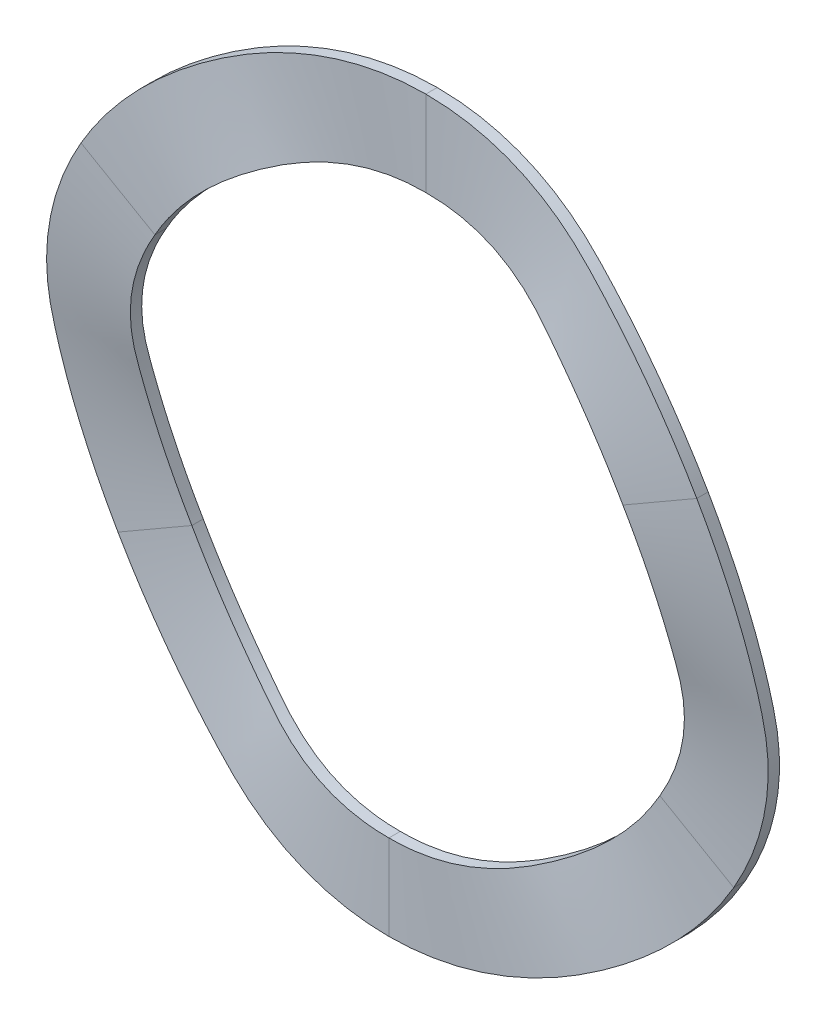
ISO-10303-21;
HEADER;
FILE_DESCRIPTION(('STEP AP214'),'2;1');
FILE_NAME('part.step','',(''),(''),'','','');
FILE_SCHEMA(('AUTOMOTIVE_DESIGN { 1 0 10303 214 1 1 1 1 }'));
ENDSEC;
DATA;
#1=APPLICATION_CONTEXT('core data for automotive mechanical design processes');
#2=APPLICATION_PROTOCOL_DEFINITION('international standard','automotive_design',2000,#1);
#3=PRODUCT_CONTEXT('',#1,'mechanical');
#4=PRODUCT('Part','Part','',(#3));
#5=PRODUCT_RELATED_PRODUCT_CATEGORY('part','',(#4));
#6=PRODUCT_DEFINITION_FORMATION('','',#4);
#7=PRODUCT_DEFINITION_CONTEXT('part definition',#1,'design');
#8=PRODUCT_DEFINITION('design','',#6,#7);
#9=PRODUCT_DEFINITION_SHAPE('','',#8);
#10=(LENGTH_UNIT() NAMED_UNIT(*) SI_UNIT(.MILLI.,.METRE.));
#11=(NAMED_UNIT(*) PLANE_ANGLE_UNIT() SI_UNIT($,.RADIAN.));
#12=(NAMED_UNIT(*) SI_UNIT($,.STERADIAN.) SOLID_ANGLE_UNIT());
#13=UNCERTAINTY_MEASURE_WITH_UNIT(LENGTH_MEASURE(1.E-05),#10,'distance_accuracy_value','');
#14=(GEOMETRIC_REPRESENTATION_CONTEXT(3) GLOBAL_UNCERTAINTY_ASSIGNED_CONTEXT((#13)) GLOBAL_UNIT_ASSIGNED_CONTEXT((#10,
#11,#12)) REPRESENTATION_CONTEXT('',''));
#15=CARTESIAN_POINT('',(0.,0.,0.));
#16=DIRECTION('',(0.,0.,1.));
#17=DIRECTION('',(1.,0.,0.));
#18=AXIS2_PLACEMENT_3D('',#15,#16,#17);
#19=CARTESIAN_POINT('',(0.,9.5,0.));
#20=CARTESIAN_POINT('',(-1.70198076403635,9.51108404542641,0.000110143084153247));
#21=CARTESIAN_POINT('',(-3.26664578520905,9.07483254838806,0.205908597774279));
#22=CARTESIAN_POINT('',(-4.75595746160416,8.23755996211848,0.650000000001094));
#23=CARTESIAN_POINT('',(-6.22571262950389,7.36641450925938,1.09409140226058));
#24=CARTESIAN_POINT('',(-7.38585001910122,6.22950060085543,1.29988985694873));
#25=CARTESIAN_POINT('',(-8.22724133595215,4.75000000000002,1.3));
#26=CARTESIAN_POINT('',(0.,9.75,0.));
#27=CARTESIAN_POINT('',(-1.73190509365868,9.76013672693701,0.000110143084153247));
#28=CARTESIAN_POINT('',(-3.34697721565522,9.31605400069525,0.205908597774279));
#29=CARTESIAN_POINT('',(-4.88098072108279,8.45410659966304,0.650000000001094));
#30=CARTESIAN_POINT('',(-6.39445081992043,7.55659429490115,1.09409140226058));
#31=CARTESIAN_POINT('',(-7.58657380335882,6.37994217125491,1.29988985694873));
#32=CARTESIAN_POINT('',(-8.44374768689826,4.87500000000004,1.3));
#33=CARTESIAN_POINT('',(0.,10.25,0.));
#34=CARTESIAN_POINT('',(-1.79175375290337,10.2582420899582,0.000110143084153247));
#35=CARTESIAN_POINT('',(-3.50764007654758,9.7984969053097,0.205908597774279));
#36=CARTESIAN_POINT('',(-5.13102724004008,8.88719987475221,0.650000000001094));
#37=CARTESIAN_POINT('',(-6.73192720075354,7.9369538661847,1.09409140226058));
#38=CARTESIAN_POINT('',(-7.98802137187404,6.68082531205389,1.29988985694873));
#39=CARTESIAN_POINT('',(-8.87676038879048,5.12500000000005,1.3));
#40=CARTESIAN_POINT('',(0.,11.,0.));
#41=CARTESIAN_POINT('',(-1.88152674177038,11.0054001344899,0.000110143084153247));
#42=CARTESIAN_POINT('',(-3.74863436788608,10.5221612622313,0.205908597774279));
#43=CARTESIAN_POINT('',(-5.50609701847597,9.53683978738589,0.650000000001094));
#44=CARTESIAN_POINT('',(-7.23814177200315,8.50749322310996,1.09409140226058));
#45=CARTESIAN_POINT('',(-8.59019272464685,7.1321500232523,1.29988985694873));
#46=CARTESIAN_POINT('',(-9.5262794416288,5.50000000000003,1.3));
#47=CARTESIAN_POINT('',(0.,11.75,0.));
#48=CARTESIAN_POINT('',(-1.97129973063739,11.7525581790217,0.000110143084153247));
#49=CARTESIAN_POINT('',(-3.98962865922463,11.245825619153,0.205908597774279));
#50=CARTESIAN_POINT('',(-5.8811667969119,10.1864797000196,0.650000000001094));
#51=CARTESIAN_POINT('',(-7.74435634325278,9.07803258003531,1.09409140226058));
#52=CARTESIAN_POINT('',(-9.1923640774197,7.58347473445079,1.29988985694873));
#53=CARTESIAN_POINT('',(-10.1757984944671,5.87500000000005,1.3));
#54=CARTESIAN_POINT('',(0.,12.25,0.));
#55=CARTESIAN_POINT('',(-2.03114838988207,12.2506635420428,0.000110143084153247));
#56=CARTESIAN_POINT('',(-4.15029152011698,11.7282685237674,0.205908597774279));
#57=CARTESIAN_POINT('',(-6.13121331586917,10.6195729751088,0.650000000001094));
#58=CARTESIAN_POINT('',(-8.08183272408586,9.45839215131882,1.09409140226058));
#59=CARTESIAN_POINT('',(-9.59381164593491,7.88435787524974,1.29988985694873));
#60=CARTESIAN_POINT('',(-10.6088111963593,6.12500000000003,1.3));
#61=CARTESIAN_POINT('',(0.,12.5,0.));
#62=CARTESIAN_POINT('',(-2.06107271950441,12.4997162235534,0.000110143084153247));
#63=CARTESIAN_POINT('',(-4.23062295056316,11.9694899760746,0.205908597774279));
#64=CARTESIAN_POINT('',(-6.25623657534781,10.8361196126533,0.650000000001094));
#65=CARTESIAN_POINT('',(-8.2505709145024,9.64857193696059,1.09409140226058));
#66=CARTESIAN_POINT('',(-9.79453543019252,8.03479944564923,1.29988985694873));
#67=CARTESIAN_POINT('',(-10.8253175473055,6.25000000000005,1.3));
#68=B_SPLINE_SURFACE_WITH_KNOTS('',3,3,((#19,#20,#21,#22,#23,#24,#25),(#26,#27,#28,#29,#30,#31,
#32),(#33,#34,#35,#36,#37,#38,#39),(#40,#41,#42,#43,#44,#45,#46),(#47,#48,#49,#50,#51,#52,#53),
(#54,#55,#56,#57,#58,#59,#60),(#61,#62,#63,#64,#65,#66,#67)),.UNSPECIFIED.,.F.,.F.,.F.,(4,1,1,1,
4),(4,1,1,1,4),(0.558823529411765,0.669117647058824,0.779411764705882,0.889705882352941,1.),(0.,
0.474999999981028,0.499999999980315,0.524999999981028,1.),.UNSPECIFIED.);
#69=DIRECTION('',(0.,1.,0.));
#70=VECTOR('',#69,1.);
#71=CARTESIAN_POINT('',(0.,12.5,0.));
#72=LINE('',#71,#70);
#73=CARTESIAN_POINT('',(0.,9.5,0.));
#74=VERTEX_POINT('',#73);
#75=CARTESIAN_POINT('',(0.,12.5,0.));
#76=VERTEX_POINT('',#75);
#77=EDGE_CURVE('E1329',#74,#76,#72,.T.);
#78=CARTESIAN_POINT('',(0.,12.5,0.));
#79=CARTESIAN_POINT('',(-2.06107271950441,12.4997162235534,0.000110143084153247));
#80=CARTESIAN_POINT('',(-4.23062295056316,11.9694899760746,0.205908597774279));
#81=CARTESIAN_POINT('',(-6.25623657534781,10.8361196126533,0.650000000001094));
#82=CARTESIAN_POINT('',(-8.2505709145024,9.64857193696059,1.09409140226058));
#83=CARTESIAN_POINT('',(-9.79453543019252,8.03479944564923,1.29988985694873));
#84=CARTESIAN_POINT('',(-10.8253175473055,6.25000000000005,1.3));
#85=B_SPLINE_CURVE_WITH_KNOTS('',3,(#78,#79,#80,#81,#82,#83,#84),.UNSPECIFIED.,.F.,.F.,(4,1,1,1,
4),(0.,0.474999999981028,0.499999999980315,0.524999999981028,1.),.UNSPECIFIED.);
#86=CARTESIAN_POINT('',(-10.8253175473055,6.25000000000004,1.3));
#87=VERTEX_POINT('',#86);
#88=EDGE_CURVE('E1241',#76,#87,#85,.T.);
#89=DIRECTION('',(-0.866025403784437,0.500000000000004,0.));
#90=VECTOR('',#89,1.);
#91=CARTESIAN_POINT('',(-10.8253175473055,6.25000000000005,1.3));
#92=LINE('',#91,#90);
#93=CARTESIAN_POINT('',(-8.22724133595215,4.75000000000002,1.3));
#94=VERTEX_POINT('',#93);
#95=EDGE_CURVE('E1196',#94,#87,#92,.T.);
#96=CARTESIAN_POINT('',(0.,9.5,0.));
#97=CARTESIAN_POINT('',(-1.70198076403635,9.51108404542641,0.000110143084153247));
#98=CARTESIAN_POINT('',(-3.26664578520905,9.07483254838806,0.205908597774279));
#99=CARTESIAN_POINT('',(-4.75595746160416,8.23755996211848,0.650000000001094));
#100=CARTESIAN_POINT('',(-6.22571262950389,7.36641450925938,1.09409140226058));
#101=CARTESIAN_POINT('',(-7.38585001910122,6.22950060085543,1.29988985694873));
#102=CARTESIAN_POINT('',(-8.22724133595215,4.75000000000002,1.3));
#103=B_SPLINE_CURVE_WITH_KNOTS('',3,(#96,#97,#98,#99,#100,#101,#102),.UNSPECIFIED.,.F.,.F.,(4,1,
1,1,4),(0.,0.474999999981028,0.499999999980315,0.524999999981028,1.),.UNSPECIFIED.);
#104=EDGE_CURVE('E1314',#74,#94,#103,.T.);
#105=ORIENTED_EDGE('',*,*,#77,.T.);
#106=ORIENTED_EDGE('',*,*,#88,.T.);
#107=ORIENTED_EDGE('',*,*,#95,.F.);
#108=ORIENTED_EDGE('',*,*,#104,.F.);
#109=EDGE_LOOP('',(#105,#106,#107,#108));
#110=FACE_BOUND('',#109,.T.);
#111=ADVANCED_FACE('F458',(#110),#68,.T.);
#112=CARTESIAN_POINT('',(0.,9.5,-0.400000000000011));
#113=CARTESIAN_POINT('',(-1.70198076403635,9.51108404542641,-0.399889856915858));
#114=CARTESIAN_POINT('',(-3.26664578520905,9.07483254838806,-0.194091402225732));
#115=CARTESIAN_POINT('',(-4.75595746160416,8.23755996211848,0.250000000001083));
#116=CARTESIAN_POINT('',(-6.22571262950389,7.36641450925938,0.694091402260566));
#117=CARTESIAN_POINT('',(-7.38585001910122,6.22950060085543,0.899889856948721));
#118=CARTESIAN_POINT('',(-8.22724133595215,4.75000000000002,0.900000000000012));
#119=CARTESIAN_POINT('',(0.,9.5,-0.366666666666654));
#120=CARTESIAN_POINT('',(-1.70198076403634,9.51108404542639,-0.366556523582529));
#121=CARTESIAN_POINT('',(-3.26664578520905,9.07483254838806,-0.160758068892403));
#122=CARTESIAN_POINT('',(-4.75595746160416,8.23755996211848,0.283333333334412));
#123=CARTESIAN_POINT('',(-6.2257126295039,7.36641450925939,0.727424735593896));
#124=CARTESIAN_POINT('',(-7.38585001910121,6.22950060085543,0.933223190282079));
#125=CARTESIAN_POINT('',(-8.22724133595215,4.75000000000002,0.933333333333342));
#126=CARTESIAN_POINT('',(0.,9.50000000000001,-0.299999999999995));
#127=CARTESIAN_POINT('',(-1.70198076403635,9.51108404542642,-0.299889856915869));
#128=CARTESIAN_POINT('',(-3.26664578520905,9.07483254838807,-0.0940914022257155));
#129=CARTESIAN_POINT('',(-4.75595746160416,8.23755996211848,0.350000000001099));
#130=CARTESIAN_POINT('',(-6.22571262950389,7.36641450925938,0.794091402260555));
#131=CARTESIAN_POINT('',(-7.38585001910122,6.22950060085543,0.999889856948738));
#132=CARTESIAN_POINT('',(-8.22724133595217,4.75000000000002,1.));
#133=CARTESIAN_POINT('',(0.,9.49999999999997,-0.200000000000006));
#134=CARTESIAN_POINT('',(-1.70198076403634,9.51108404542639,-0.199889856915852));
#135=CARTESIAN_POINT('',(-3.26664578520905,9.07483254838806,0.00590859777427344));
#136=CARTESIAN_POINT('',(-4.75595746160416,8.23755996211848,0.450000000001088));
#137=CARTESIAN_POINT('',(-6.2257126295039,7.36641450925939,0.894091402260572));
#138=CARTESIAN_POINT('',(-7.38585001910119,6.22950060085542,1.09988985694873));
#139=CARTESIAN_POINT('',(-8.22724133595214,4.75000000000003,1.09999999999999));
#140=CARTESIAN_POINT('',(0.,9.50000000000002,-0.099999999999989));
#141=CARTESIAN_POINT('',(-1.70198076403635,9.51108404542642,-0.0998898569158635));
#142=CARTESIAN_POINT('',(-3.26664578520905,9.07483254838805,0.10590859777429));
#143=CARTESIAN_POINT('',(-4.75595746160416,8.23755996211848,0.550000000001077));
#144=CARTESIAN_POINT('',(-6.22571262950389,7.36641450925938,0.994091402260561));
#145=CARTESIAN_POINT('',(-7.38585001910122,6.22950060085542,1.19988985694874));
#146=CARTESIAN_POINT('',(-8.22724133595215,4.75000000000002,1.20000000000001));
#147=CARTESIAN_POINT('',(0.,9.5,-0.0333333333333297));
#148=CARTESIAN_POINT('',(-1.70198076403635,9.51108404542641,-0.0332231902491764));
#149=CARTESIAN_POINT('',(-3.26664578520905,9.07483254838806,0.17257526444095));
#150=CARTESIAN_POINT('',(-4.75595746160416,8.23755996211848,0.616666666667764));
#151=CARTESIAN_POINT('',(-6.22571262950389,7.36641450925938,1.06075806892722));
#152=CARTESIAN_POINT('',(-7.38585001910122,6.22950060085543,1.2665565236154));
#153=CARTESIAN_POINT('',(-8.22724133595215,4.75000000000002,1.26666666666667));
#154=CARTESIAN_POINT('',(0.,9.5,0.));
#155=CARTESIAN_POINT('',(-1.70198076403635,9.51108404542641,0.000110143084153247));
#156=CARTESIAN_POINT('',(-3.26664578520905,9.07483254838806,0.205908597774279));
#157=CARTESIAN_POINT('',(-4.75595746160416,8.23755996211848,0.650000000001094));
#158=CARTESIAN_POINT('',(-6.22571262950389,7.36641450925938,1.09409140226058));
#159=CARTESIAN_POINT('',(-7.38585001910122,6.22950060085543,1.29988985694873));
#160=CARTESIAN_POINT('',(-8.22724133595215,4.75000000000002,1.3));
#161=B_SPLINE_SURFACE_WITH_KNOTS('',3,3,((#112,#113,#114,#115,#116,#117,#118),(#119,#120,#121,
#122,#123,#124,#125),(#126,#127,#128,#129,#130,#131,#132),(#133,#134,#135,#136,#137,#138,#139),
(#140,#141,#142,#143,#144,#145,#146),(#147,#148,#149,#150,#151,#152,#153),(#154,#155,#156,#157,
#158,#159,#160)),.UNSPECIFIED.,.F.,.F.,.F.,(4,1,1,1,4),(4,1,1,1,4),(0.5,0.514705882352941,
0.529411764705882,0.544117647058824,0.558823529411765),(0.,0.474999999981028,0.499999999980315,
0.524999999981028,1.),.UNSPECIFIED.);
#162=DIRECTION('',(0.,0.,1.));
#163=VECTOR('',#162,1.);
#164=CARTESIAN_POINT('',(0.,9.5,0.));
#165=LINE('',#164,#163);
#166=CARTESIAN_POINT('',(0.,9.5,-0.400000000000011));
#167=VERTEX_POINT('',#166);
#168=EDGE_CURVE('E1344',#167,#74,#165,.T.);
#169=DIRECTION('',(0.,0.,1.));
#170=VECTOR('',#169,1.);
#171=CARTESIAN_POINT('',(-8.22724133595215,4.75000000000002,1.3));
#172=LINE('',#171,#170);
#173=CARTESIAN_POINT('',(-8.22724133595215,4.75000000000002,0.900000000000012));
#174=VERTEX_POINT('',#173);
#175=EDGE_CURVE('E485',#174,#94,#172,.T.);
#176=CARTESIAN_POINT('',(0.,9.5,-0.400000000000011));
#177=CARTESIAN_POINT('',(-1.70198076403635,9.51108404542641,-0.399889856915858));
#178=CARTESIAN_POINT('',(-3.26664578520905,9.07483254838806,-0.194091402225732));
#179=CARTESIAN_POINT('',(-4.75595746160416,8.23755996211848,0.250000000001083));
#180=CARTESIAN_POINT('',(-6.22571262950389,7.36641450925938,0.694091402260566));
#181=CARTESIAN_POINT('',(-7.38585001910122,6.22950060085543,0.899889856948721));
#182=CARTESIAN_POINT('',(-8.22724133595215,4.75000000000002,0.900000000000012));
#183=B_SPLINE_CURVE_WITH_KNOTS('',3,(#176,#177,#178,#179,#180,#181,#182),.UNSPECIFIED.,.F.,.F.,
(4,1,1,1,4),(0.,0.474999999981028,0.499999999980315,0.524999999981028,1.),.UNSPECIFIED.);
#184=EDGE_CURVE('E1210',#167,#174,#183,.T.);
#185=ORIENTED_EDGE('',*,*,#168,.T.);
#186=ORIENTED_EDGE('',*,*,#104,.T.);
#187=ORIENTED_EDGE('',*,*,#175,.F.);
#188=ORIENTED_EDGE('',*,*,#184,.F.);
#189=EDGE_LOOP('',(#185,#186,#187,#188));
#190=FACE_BOUND('',#189,.T.);
#191=ADVANCED_FACE('F1291',(#190),#161,.T.);
#192=CARTESIAN_POINT('',(0.,12.5,-0.400000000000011));
#193=CARTESIAN_POINT('',(-2.06107271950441,12.4997162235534,-0.399889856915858));
#194=CARTESIAN_POINT('',(-4.23062295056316,11.9694899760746,-0.194091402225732));
#195=CARTESIAN_POINT('',(-6.25623657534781,10.8361196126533,0.250000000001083));
#196=CARTESIAN_POINT('',(-8.2505709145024,9.64857193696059,0.694091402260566));
#197=CARTESIAN_POINT('',(-9.79453543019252,8.03479944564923,0.899889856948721));
#198=CARTESIAN_POINT('',(-10.8253175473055,6.25000000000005,0.900000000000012));
#199=CARTESIAN_POINT('',(0.,12.25,-0.400000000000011));
#200=CARTESIAN_POINT('',(-2.03114838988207,12.2506635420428,-0.399889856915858));
#201=CARTESIAN_POINT('',(-4.15029152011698,11.7282685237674,-0.194091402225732));
#202=CARTESIAN_POINT('',(-6.13121331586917,10.6195729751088,0.250000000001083));
#203=CARTESIAN_POINT('',(-8.08183272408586,9.45839215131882,0.694091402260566));
#204=CARTESIAN_POINT('',(-9.59381164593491,7.88435787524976,0.899889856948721));
#205=CARTESIAN_POINT('',(-10.6088111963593,6.12500000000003,0.900000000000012));
#206=CARTESIAN_POINT('',(0.,11.75,-0.400000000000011));
#207=CARTESIAN_POINT('',(-1.97129973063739,11.7525581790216,-0.399889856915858));
#208=CARTESIAN_POINT('',(-3.98962865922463,11.2458256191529,-0.194091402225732));
#209=CARTESIAN_POINT('',(-5.8811667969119,10.1864797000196,0.250000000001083));
#210=CARTESIAN_POINT('',(-7.74435634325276,9.0780325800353,0.694091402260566));
#211=CARTESIAN_POINT('',(-9.19236407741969,7.58347473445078,0.899889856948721));
#212=CARTESIAN_POINT('',(-10.1757984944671,5.87500000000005,0.900000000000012));
#213=CARTESIAN_POINT('',(0.,11.,-0.400000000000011));
#214=CARTESIAN_POINT('',(-1.88152674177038,11.0054001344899,-0.399889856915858));
#215=CARTESIAN_POINT('',(-3.7486343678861,10.5221612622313,-0.194091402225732));
#216=CARTESIAN_POINT('',(-5.50609701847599,9.5368397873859,0.250000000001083));
#217=CARTESIAN_POINT('',(-7.23814177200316,8.50749322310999,0.694091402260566));
#218=CARTESIAN_POINT('',(-8.59019272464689,7.13215002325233,0.899889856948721));
#219=CARTESIAN_POINT('',(-9.52627944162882,5.50000000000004,0.900000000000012));
#220=CARTESIAN_POINT('',(0.,10.25,-0.400000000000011));
#221=CARTESIAN_POINT('',(-1.79175375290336,10.2582420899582,-0.399889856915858));
#222=CARTESIAN_POINT('',(-3.50764007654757,9.79849690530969,-0.194091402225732));
#223=CARTESIAN_POINT('',(-5.13102724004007,8.88719987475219,0.250000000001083));
#224=CARTESIAN_POINT('',(-6.73192720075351,7.9369538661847,0.694091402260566));
#225=CARTESIAN_POINT('',(-7.98802137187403,6.68082531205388,0.899889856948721));
#226=CARTESIAN_POINT('',(-8.87676038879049,5.12500000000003,0.900000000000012));
#227=CARTESIAN_POINT('',(0.,9.75,-0.400000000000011));
#228=CARTESIAN_POINT('',(-1.73190509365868,9.76013672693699,-0.399889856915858));
#229=CARTESIAN_POINT('',(-3.34697721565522,9.31605400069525,-0.194091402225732));
#230=CARTESIAN_POINT('',(-4.88098072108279,8.45410659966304,0.250000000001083));
#231=CARTESIAN_POINT('',(-6.39445081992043,7.55659429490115,0.694091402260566));
#232=CARTESIAN_POINT('',(-7.58657380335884,6.37994217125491,0.899889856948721));
#233=CARTESIAN_POINT('',(-8.44374768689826,4.87500000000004,0.900000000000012));
#234=CARTESIAN_POINT('',(0.,9.5,-0.400000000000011));
#235=CARTESIAN_POINT('',(-1.70198076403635,9.51108404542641,-0.399889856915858));
#236=CARTESIAN_POINT('',(-3.26664578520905,9.07483254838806,-0.194091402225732));
#237=CARTESIAN_POINT('',(-4.75595746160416,8.23755996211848,0.250000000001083));
#238=CARTESIAN_POINT('',(-6.22571262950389,7.36641450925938,0.694091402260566));
#239=CARTESIAN_POINT('',(-7.38585001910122,6.22950060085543,0.899889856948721));
#240=CARTESIAN_POINT('',(-8.22724133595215,4.75000000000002,0.900000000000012));
#241=B_SPLINE_SURFACE_WITH_KNOTS('',3,3,((#192,#193,#194,#195,#196,#197,#198),(#199,#200,#201,
#202,#203,#204,#205),(#206,#207,#208,#209,#210,#211,#212),(#213,#214,#215,#216,#217,#218,#219),
(#220,#221,#222,#223,#224,#225,#226),(#227,#228,#229,#230,#231,#232,#233),(#234,#235,#236,#237,
#238,#239,#240)),.UNSPECIFIED.,.F.,.F.,.F.,(4,1,1,1,4),(4,1,1,1,4),(0.0588235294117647,
0.169117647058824,0.279411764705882,0.389705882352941,0.5),(0.,0.474999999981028,
0.499999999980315,0.524999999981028,1.),.UNSPECIFIED.);
#242=DIRECTION('',(0.,-1.,0.));
#243=VECTOR('',#242,1.);
#244=CARTESIAN_POINT('',(0.,12.5,-0.400000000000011));
#245=LINE('',#244,#243);
#246=CARTESIAN_POINT('',(0.,12.5,-0.400000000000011));
#247=VERTEX_POINT('',#246);
#248=EDGE_CURVE('E464',#247,#167,#245,.T.);
#249=DIRECTION('',(0.866025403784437,-0.500000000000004,0.));
#250=VECTOR('',#249,1.);
#251=CARTESIAN_POINT('',(-10.8253175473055,6.25000000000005,0.900000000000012));
#252=LINE('',#251,#250);
#253=CARTESIAN_POINT('',(-10.8253175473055,6.25000000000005,0.900000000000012));
#254=VERTEX_POINT('',#253);
#255=EDGE_CURVE('E1121',#254,#174,#252,.T.);
#256=CARTESIAN_POINT('',(0.,12.5,-0.400000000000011));
#257=CARTESIAN_POINT('',(-2.06107271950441,12.4997162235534,-0.399889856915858));
#258=CARTESIAN_POINT('',(-4.23062295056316,11.9694899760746,-0.194091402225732));
#259=CARTESIAN_POINT('',(-6.25623657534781,10.8361196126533,0.250000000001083));
#260=CARTESIAN_POINT('',(-8.2505709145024,9.64857193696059,0.694091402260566));
#261=CARTESIAN_POINT('',(-9.79453543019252,8.03479944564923,0.899889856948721));
#262=CARTESIAN_POINT('',(-10.8253175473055,6.25000000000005,0.900000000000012));
#263=B_SPLINE_CURVE_WITH_KNOTS('',3,(#256,#257,#258,#259,#260,#261,#262),.UNSPECIFIED.,.F.,.F.,
(4,1,1,1,4),(0.,0.474999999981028,0.499999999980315,0.524999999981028,1.),.UNSPECIFIED.);
#264=EDGE_CURVE('E1207',#247,#254,#263,.T.);
#265=ORIENTED_EDGE('',*,*,#248,.T.);
#266=ORIENTED_EDGE('',*,*,#184,.T.);
#267=ORIENTED_EDGE('',*,*,#255,.F.);
#268=ORIENTED_EDGE('',*,*,#264,.F.);
#269=EDGE_LOOP('',(#265,#266,#267,#268));
#270=FACE_BOUND('',#269,.T.);
#271=ADVANCED_FACE('F1254',(#270),#241,.T.);
#272=CARTESIAN_POINT('',(0.,12.5,0.));
#273=CARTESIAN_POINT('',(-2.06107271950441,12.4997162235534,0.000110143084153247));
#274=CARTESIAN_POINT('',(-4.23062295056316,11.9694899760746,0.205908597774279));
#275=CARTESIAN_POINT('',(-6.25623657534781,10.8361196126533,0.650000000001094));
#276=CARTESIAN_POINT('',(-8.2505709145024,9.64857193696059,1.09409140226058));
#277=CARTESIAN_POINT('',(-9.79453543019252,8.03479944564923,1.29988985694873));
#278=CARTESIAN_POINT('',(-10.8253175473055,6.25000000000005,1.3));
#279=CARTESIAN_POINT('',(0.,12.5,-0.0333333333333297));
#280=CARTESIAN_POINT('',(-2.06107271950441,12.4997162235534,-0.0332231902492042));
#281=CARTESIAN_POINT('',(-4.23062295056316,11.9694899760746,0.17257526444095));
#282=CARTESIAN_POINT('',(-6.25623657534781,10.8361196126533,0.616666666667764));
#283=CARTESIAN_POINT('',(-8.2505709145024,9.64857193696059,1.06075806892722));
#284=CARTESIAN_POINT('',(-9.79453543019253,8.03479944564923,1.2665565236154));
#285=CARTESIAN_POINT('',(-10.8253175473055,6.25000000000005,1.26666666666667));
#286=CARTESIAN_POINT('',(0.,12.5,-0.099999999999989));
#287=CARTESIAN_POINT('',(-2.0610727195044,12.4997162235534,-0.0998898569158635));
#288=CARTESIAN_POINT('',(-4.23062295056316,11.9694899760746,0.105908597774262));
#289=CARTESIAN_POINT('',(-6.25623657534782,10.8361196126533,0.550000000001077));
#290=CARTESIAN_POINT('',(-8.2505709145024,9.64857193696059,0.994091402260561));
#291=CARTESIAN_POINT('',(-9.79453543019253,8.03479944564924,1.19988985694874));
#292=CARTESIAN_POINT('',(-10.8253175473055,6.25000000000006,1.20000000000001));
#293=CARTESIAN_POINT('',(0.,12.5,-0.200000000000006));
#294=CARTESIAN_POINT('',(-2.06107271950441,12.4997162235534,-0.199889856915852));
#295=CARTESIAN_POINT('',(-4.23062295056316,11.9694899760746,0.00590859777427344));
#296=CARTESIAN_POINT('',(-6.25623657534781,10.8361196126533,0.450000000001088));
#297=CARTESIAN_POINT('',(-8.25057091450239,9.6485719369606,0.894091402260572));
#298=CARTESIAN_POINT('',(-9.79453543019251,8.03479944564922,1.09988985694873));
#299=CARTESIAN_POINT('',(-10.8253175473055,6.25000000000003,1.09999999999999));
#300=CARTESIAN_POINT('',(0.,12.5,-0.299999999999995));
#301=CARTESIAN_POINT('',(-2.06107271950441,12.4997162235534,-0.299889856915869));
#302=CARTESIAN_POINT('',(-4.23062295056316,11.9694899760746,-0.0940914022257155));
#303=CARTESIAN_POINT('',(-6.25623657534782,10.8361196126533,0.350000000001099));
#304=CARTESIAN_POINT('',(-8.2505709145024,9.64857193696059,0.794091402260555));
#305=CARTESIAN_POINT('',(-9.79453543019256,8.03479944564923,0.999889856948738));
#306=CARTESIAN_POINT('',(-10.8253175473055,6.25000000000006,1.));
#307=CARTESIAN_POINT('',(0.,12.5,-0.366666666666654));
#308=CARTESIAN_POINT('',(-2.0610727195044,12.4997162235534,-0.366556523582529));
#309=CARTESIAN_POINT('',(-4.23062295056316,11.9694899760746,-0.160758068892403));
#310=CARTESIAN_POINT('',(-6.25623657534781,10.8361196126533,0.283333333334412));
#311=CARTESIAN_POINT('',(-8.2505709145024,9.64857193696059,0.727424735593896));
#312=CARTESIAN_POINT('',(-9.79453543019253,8.03479944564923,0.933223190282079));
#313=CARTESIAN_POINT('',(-10.8253175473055,6.25000000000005,0.933333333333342));
#314=CARTESIAN_POINT('',(0.,12.5,-0.400000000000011));
#315=CARTESIAN_POINT('',(-2.06107271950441,12.4997162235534,-0.399889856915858));
#316=CARTESIAN_POINT('',(-4.23062295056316,11.9694899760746,-0.194091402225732));
#317=CARTESIAN_POINT('',(-6.25623657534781,10.8361196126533,0.250000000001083));
#318=CARTESIAN_POINT('',(-8.2505709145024,9.64857193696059,0.694091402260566));
#319=CARTESIAN_POINT('',(-9.79453543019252,8.03479944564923,0.899889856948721));
#320=CARTESIAN_POINT('',(-10.8253175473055,6.25000000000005,0.900000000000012));
#321=B_SPLINE_SURFACE_WITH_KNOTS('',3,3,((#272,#273,#274,#275,#276,#277,#278),(#279,#280,#281,
#282,#283,#284,#285),(#286,#287,#288,#289,#290,#291,#292),(#293,#294,#295,#296,#297,#298,#299),
(#300,#301,#302,#303,#304,#305,#306),(#307,#308,#309,#310,#311,#312,#313),(#314,#315,#316,#317,
#318,#319,#320)),.UNSPECIFIED.,.F.,.F.,.F.,(4,1,1,1,4),(4,1,1,1,4),(0.,0.0147058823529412,
0.0294117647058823,0.0441176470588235,0.0588235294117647),(0.,0.474999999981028,
0.499999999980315,0.524999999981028,1.),.UNSPECIFIED.);
#322=DIRECTION('',(0.,0.,-1.));
#323=VECTOR('',#322,1.);
#324=CARTESIAN_POINT('',(0.,12.5,0.));
#325=LINE('',#324,#323);
#326=EDGE_CURVE('E13',#76,#247,#325,.T.);
#327=DIRECTION('',(0.,0.,-1.));
#328=VECTOR('',#327,1.);
#329=CARTESIAN_POINT('',(-10.8253175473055,6.25000000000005,1.3));
#330=LINE('',#329,#328);
#331=EDGE_CURVE('E1224',#87,#254,#330,.T.);
#332=ORIENTED_EDGE('',*,*,#326,.T.);
#333=ORIENTED_EDGE('',*,*,#264,.T.);
#334=ORIENTED_EDGE('',*,*,#331,.F.);
#335=ORIENTED_EDGE('',*,*,#88,.F.);
#336=EDGE_LOOP('',(#332,#333,#334,#335));
#337=FACE_BOUND('',#336,.T.);
#338=ADVANCED_FACE('F1243',(#337),#321,.T.);
#339=CARTESIAN_POINT('',(-8.22724133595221,-4.74999999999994,0.));
#340=CARTESIAN_POINT('',(-9.08783078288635,-3.28158344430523,0.000110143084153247));
#341=CARTESIAN_POINT('',(-9.49235841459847,-1.70841803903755,0.205908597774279));
#342=CARTESIAN_POINT('',(-9.51191492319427,8.19483370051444E-12,0.650000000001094));
#343=CARTESIAN_POINT('',(-9.49235841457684,1.70841803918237,1.09409140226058));
#344=CARTESIAN_POINT('',(-9.0878307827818,3.28158344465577,1.29988985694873));
#345=CARTESIAN_POINT('',(-8.22724133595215,4.75000000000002,1.3));
#346=CARTESIAN_POINT('',(-8.44374768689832,-4.87499999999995,0.));
#347=CARTESIAN_POINT('',(-9.31847889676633,-3.38019455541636,0.000110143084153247));
#348=CARTESIAN_POINT('',(-9.74142803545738,-1.75945970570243,0.205908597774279));
#349=CARTESIAN_POINT('',(-9.7619614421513,8.3474893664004E-12,0.650000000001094));
#350=CARTESIAN_POINT('',(-9.74142803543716,1.75945970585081,1.09409140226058));
#351=CARTESIAN_POINT('',(-9.31847889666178,3.38019455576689,1.29988985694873));
#352=CARTESIAN_POINT('',(-8.44374768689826,4.87500000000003,1.3));
#353=CARTESIAN_POINT('',(-8.87676038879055,-5.12499999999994,0.));
#354=CARTESIAN_POINT('',(-9.77977512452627,-3.57741677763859,0.000110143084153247));
#355=CARTESIAN_POINT('',(-10.2395672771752,-1.86154303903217,0.205908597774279));
#356=CARTESIAN_POINT('',(-10.2620544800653,8.63198401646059E-12,0.650000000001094));
#357=CARTESIAN_POINT('',(-10.2395672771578,1.86154303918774,1.09409140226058));
#358=CARTESIAN_POINT('',(-9.77977512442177,3.57741677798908,1.29988985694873));
#359=CARTESIAN_POINT('',(-8.87676038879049,5.12500000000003,1.3));
#360=CARTESIAN_POINT('',(-9.52627944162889,-5.49999999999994,0.));
#361=CARTESIAN_POINT('',(-10.4717194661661,-3.87325011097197,0.000110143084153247));
#362=CARTESIAN_POINT('',(-10.9867761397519,-2.01466803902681,0.205908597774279));
#363=CARTESIAN_POINT('',(-11.0121940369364,9.09688990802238E-12,0.650000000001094));
#364=CARTESIAN_POINT('',(-10.9867761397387,2.01466803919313,1.09409140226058));
#365=CARTESIAN_POINT('',(-10.4717194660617,3.87325011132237,1.29988985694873));
#366=CARTESIAN_POINT('',(-9.5262794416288,5.50000000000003,1.3));
#367=CARTESIAN_POINT('',(-10.1757984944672,-5.87499999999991,0.));
#368=CARTESIAN_POINT('',(-11.1636638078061,-4.16908344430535,0.000110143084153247));
#369=CARTESIAN_POINT('',(-11.7339850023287,-2.16779303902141,0.205908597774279));
#370=CARTESIAN_POINT('',(-11.7623335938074,9.54791801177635E-12,0.650000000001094));
#371=CARTESIAN_POINT('',(-11.7339850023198,2.16779303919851,1.09409140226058));
#372=CARTESIAN_POINT('',(-11.1636638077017,4.16908344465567,1.29988985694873));
#373=CARTESIAN_POINT('',(-10.1757984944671,5.87500000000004,1.3));
#374=CARTESIAN_POINT('',(-10.6088111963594,-6.12499999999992,0.));
#375=CARTESIAN_POINT('',(-11.624960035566,-4.36630566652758,0.000110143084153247));
#376=CARTESIAN_POINT('',(-12.2321242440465,-2.26987637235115,0.205908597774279));
#377=CARTESIAN_POINT('',(-12.2624266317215,9.83935155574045E-12,0.650000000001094));
#378=CARTESIAN_POINT('',(-12.2321242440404,2.26987637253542,1.09409140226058));
#379=CARTESIAN_POINT('',(-11.6249600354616,4.36630566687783,1.29988985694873));
#380=CARTESIAN_POINT('',(-10.6088111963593,6.12500000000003,1.3));
#381=CARTESIAN_POINT('',(-10.8253175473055,-6.24999999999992,0.));
#382=CARTESIAN_POINT('',(-11.855608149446,-4.46491677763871,0.000110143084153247));
#383=CARTESIAN_POINT('',(-12.4811938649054,-2.32091803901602,0.205908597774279));
#384=CARTESIAN_POINT('',(-12.5124731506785,9.9850683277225E-12,0.650000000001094));
#385=CARTESIAN_POINT('',(-12.4811938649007,2.32091803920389,1.09409140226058));
#386=CARTESIAN_POINT('',(-11.8556081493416,4.46491677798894,1.29988985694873));
#387=CARTESIAN_POINT('',(-10.8253175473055,6.25000000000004,1.3));
#388=B_SPLINE_SURFACE_WITH_KNOTS('',3,3,((#339,#340,#341,#342,#343,#344,#345),(#346,#347,#348,
#349,#350,#351,#352),(#353,#354,#355,#356,#357,#358,#359),(#360,#361,#362,#363,#364,#365,#366),
(#367,#368,#369,#370,#371,#372,#373),(#374,#375,#376,#377,#378,#379,#380),(#381,#382,#383,#384,
#385,#386,#387)),.UNSPECIFIED.,.F.,.F.,.F.,(4,1,1,1,4),(4,1,1,1,4),(0.558823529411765,
0.669117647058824,0.779411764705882,0.889705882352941,1.),(0.,0.474999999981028,
0.499999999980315,0.524999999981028,1.),.UNSPECIFIED.);
#389=DIRECTION('',(-0.866025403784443,-0.499999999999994,0.));
#390=VECTOR('',#389,1.);
#391=CARTESIAN_POINT('',(-10.8253175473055,-6.24999999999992,0.));
#392=LINE('',#391,#390);
#393=CARTESIAN_POINT('',(-8.22724133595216,-4.75000000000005,0.));
#394=VERTEX_POINT('',#393);
#395=CARTESIAN_POINT('',(-10.8253175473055,-6.24999999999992,0.));
#396=VERTEX_POINT('',#395);
#397=EDGE_CURVE('E920',#394,#396,#392,.T.);
#398=CARTESIAN_POINT('',(-8.22724133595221,-4.74999999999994,0.));
#399=CARTESIAN_POINT('',(-9.08783078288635,-3.28158344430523,0.000110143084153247));
#400=CARTESIAN_POINT('',(-9.49235841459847,-1.70841803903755,0.205908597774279));
#401=CARTESIAN_POINT('',(-9.51191492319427,8.19483370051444E-12,0.650000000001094));
#402=CARTESIAN_POINT('',(-9.49235841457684,1.70841803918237,1.09409140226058));
#403=CARTESIAN_POINT('',(-9.0878307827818,3.28158344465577,1.29988985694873));
#404=CARTESIAN_POINT('',(-8.22724133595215,4.75000000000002,1.3));
#405=B_SPLINE_CURVE_WITH_KNOTS('',3,(#398,#399,#400,#401,#402,#403,#404),.UNSPECIFIED.,.F.,.F.,
(4,1,1,1,4),(0.,0.474999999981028,0.499999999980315,0.524999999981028,1.),.UNSPECIFIED.);
#406=EDGE_CURVE('E1168',#394,#94,#405,.T.);
#407=CARTESIAN_POINT('',(-10.8253175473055,-6.24999999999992,0.));
#408=CARTESIAN_POINT('',(-11.855608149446,-4.46491677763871,0.000110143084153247));
#409=CARTESIAN_POINT('',(-12.4811938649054,-2.32091803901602,0.205908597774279));
#410=CARTESIAN_POINT('',(-12.5124731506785,9.9850683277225E-12,0.650000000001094));
#411=CARTESIAN_POINT('',(-12.4811938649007,2.32091803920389,1.09409140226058));
#412=CARTESIAN_POINT('',(-11.8556081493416,4.46491677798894,1.29988985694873));
#413=CARTESIAN_POINT('',(-10.8253175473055,6.25000000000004,1.3));
#414=B_SPLINE_CURVE_WITH_KNOTS('',3,(#407,#408,#409,#410,#411,#412,#413),.UNSPECIFIED.,.F.,.F.,
(4,1,1,1,4),(0.,0.474999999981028,0.499999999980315,0.524999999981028,1.),.UNSPECIFIED.);
#415=EDGE_CURVE('E1082',#396,#87,#414,.T.);
#416=ORIENTED_EDGE('',*,*,#397,.F.);
#417=ORIENTED_EDGE('',*,*,#406,.T.);
#418=ORIENTED_EDGE('',*,*,#95,.T.);
#419=ORIENTED_EDGE('',*,*,#415,.F.);
#420=EDGE_LOOP('',(#416,#417,#418,#419));
#421=FACE_BOUND('',#420,.T.);
#422=ADVANCED_FACE('F1150',(#421),#388,.F.);
#423=CARTESIAN_POINT('',(-8.22724133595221,-4.74999999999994,-0.400000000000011));
#424=CARTESIAN_POINT('',(-9.08783078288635,-3.28158344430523,-0.399889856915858));
#425=CARTESIAN_POINT('',(-9.49235841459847,-1.70841803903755,-0.194091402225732));
#426=CARTESIAN_POINT('',(-9.51191492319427,8.19483370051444E-12,0.250000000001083));
#427=CARTESIAN_POINT('',(-9.49235841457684,1.70841803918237,0.694091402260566));
#428=CARTESIAN_POINT('',(-9.0878307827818,3.28158344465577,0.899889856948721));
#429=CARTESIAN_POINT('',(-8.22724133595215,4.75000000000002,0.900000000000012));
#430=CARTESIAN_POINT('',(-8.22724133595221,-4.74999999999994,-0.366666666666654));
#431=CARTESIAN_POINT('',(-9.08783078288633,-3.28158344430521,-0.366556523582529));
#432=CARTESIAN_POINT('',(-9.49235841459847,-1.70841803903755,-0.160758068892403));
#433=CARTESIAN_POINT('',(-9.51191492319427,8.19483370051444E-12,0.283333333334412));
#434=CARTESIAN_POINT('',(-9.49235841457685,1.70841803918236,0.727424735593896));
#435=CARTESIAN_POINT('',(-9.0878307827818,3.28158344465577,0.933223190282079));
#436=CARTESIAN_POINT('',(-8.22724133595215,4.75000000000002,0.933333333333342));
#437=CARTESIAN_POINT('',(-8.22724133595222,-4.74999999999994,-0.299999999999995));
#438=CARTESIAN_POINT('',(-9.08783078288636,-3.28158344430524,-0.299889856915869));
#439=CARTESIAN_POINT('',(-9.49235841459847,-1.70841803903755,-0.0940914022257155));
#440=CARTESIAN_POINT('',(-9.51191492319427,8.17401701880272E-12,0.350000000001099));
#441=CARTESIAN_POINT('',(-9.49235841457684,1.70841803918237,0.794091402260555));
#442=CARTESIAN_POINT('',(-9.0878307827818,3.2815834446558,0.999889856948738));
#443=CARTESIAN_POINT('',(-8.22724133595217,4.75000000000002,1.));
#444=CARTESIAN_POINT('',(-8.22724133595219,-4.74999999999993,-0.200000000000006));
#445=CARTESIAN_POINT('',(-9.08783078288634,-3.28158344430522,-0.199889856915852));
#446=CARTESIAN_POINT('',(-9.49235841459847,-1.70841803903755,0.00590859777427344));
#447=CARTESIAN_POINT('',(-9.51191492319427,8.19483370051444E-12,0.450000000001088));
#448=CARTESIAN_POINT('',(-9.49235841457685,1.70841803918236,0.894091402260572));
#449=CARTESIAN_POINT('',(-9.0878307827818,3.28158344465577,1.09988985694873));
#450=CARTESIAN_POINT('',(-8.22724133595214,4.75000000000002,1.09999999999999));
#451=CARTESIAN_POINT('',(-8.22724133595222,-4.74999999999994,-0.099999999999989));
#452=CARTESIAN_POINT('',(-9.08783078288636,-3.28158344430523,-0.0998898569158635));
#453=CARTESIAN_POINT('',(-9.49235841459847,-1.70841803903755,0.10590859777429));
#454=CARTESIAN_POINT('',(-9.51191492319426,8.18095591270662E-12,0.550000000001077));
#455=CARTESIAN_POINT('',(-9.49235841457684,1.70841803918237,0.994091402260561));
#456=CARTESIAN_POINT('',(-9.0878307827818,3.2815834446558,1.19988985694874));
#457=CARTESIAN_POINT('',(-8.22724133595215,4.75000000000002,1.20000000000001));
#458=CARTESIAN_POINT('',(-8.22724133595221,-4.74999999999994,-0.0333333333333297));
#459=CARTESIAN_POINT('',(-9.08783078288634,-3.28158344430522,-0.0332231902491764));
#460=CARTESIAN_POINT('',(-9.49235841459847,-1.70841803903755,0.17257526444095));
#461=CARTESIAN_POINT('',(-9.51191492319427,8.19483370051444E-12,0.616666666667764));
#462=CARTESIAN_POINT('',(-9.49235841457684,1.70841803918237,1.06075806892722));
#463=CARTESIAN_POINT('',(-9.0878307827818,3.28158344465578,1.2665565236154));
#464=CARTESIAN_POINT('',(-8.22724133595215,4.75000000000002,1.26666666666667));
#465=CARTESIAN_POINT('',(-8.22724133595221,-4.74999999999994,0.));
#466=CARTESIAN_POINT('',(-9.08783078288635,-3.28158344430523,0.000110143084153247));
#467=CARTESIAN_POINT('',(-9.49235841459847,-1.70841803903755,0.205908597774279));
#468=CARTESIAN_POINT('',(-9.51191492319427,8.19483370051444E-12,0.650000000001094));
#469=CARTESIAN_POINT('',(-9.49235841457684,1.70841803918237,1.09409140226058));
#470=CARTESIAN_POINT('',(-9.0878307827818,3.28158344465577,1.29988985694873));
#471=CARTESIAN_POINT('',(-8.22724133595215,4.75000000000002,1.3));
#472=B_SPLINE_SURFACE_WITH_KNOTS('',3,3,((#423,#424,#425,#426,#427,#428,#429),(#430,#431,#432,
#433,#434,#435,#436),(#437,#438,#439,#440,#441,#442,#443),(#444,#445,#446,#447,#448,#449,#450),
(#451,#452,#453,#454,#455,#456,#457),(#458,#459,#460,#461,#462,#463,#464),(#465,#466,#467,#468,
#469,#470,#471)),.UNSPECIFIED.,.F.,.F.,.F.,(4,1,1,1,4),(4,1,1,1,4),(0.5,0.514705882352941,
0.529411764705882,0.544117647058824,0.558823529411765),(0.,0.474999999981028,0.499999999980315,
0.524999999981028,1.),.UNSPECIFIED.);
#473=DIRECTION('',(0.,0.,1.));
#474=VECTOR('',#473,1.);
#475=CARTESIAN_POINT('',(-8.22724133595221,-4.74999999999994,0.));
#476=LINE('',#475,#474);
#477=CARTESIAN_POINT('',(-8.22724133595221,-4.74999999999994,-0.400000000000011));
#478=VERTEX_POINT('',#477);
#479=EDGE_CURVE('E1226',#478,#394,#476,.T.);
#480=CARTESIAN_POINT('',(-8.22724133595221,-4.74999999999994,-0.400000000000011));
#481=CARTESIAN_POINT('',(-9.08783078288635,-3.28158344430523,-0.399889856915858));
#482=CARTESIAN_POINT('',(-9.49235841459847,-1.70841803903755,-0.194091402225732));
#483=CARTESIAN_POINT('',(-9.51191492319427,8.19483370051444E-12,0.250000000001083));
#484=CARTESIAN_POINT('',(-9.49235841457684,1.70841803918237,0.694091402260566));
#485=CARTESIAN_POINT('',(-9.0878307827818,3.28158344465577,0.899889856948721));
#486=CARTESIAN_POINT('',(-8.22724133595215,4.75000000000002,0.900000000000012));
#487=B_SPLINE_CURVE_WITH_KNOTS('',3,(#480,#481,#482,#483,#484,#485,#486),.UNSPECIFIED.,.F.,.F.,
(4,1,1,1,4),(0.,0.474999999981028,0.499999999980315,0.524999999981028,1.),.UNSPECIFIED.);
#488=EDGE_CURVE('E1176',#478,#174,#487,.T.);
#489=ORIENTED_EDGE('',*,*,#479,.F.);
#490=ORIENTED_EDGE('',*,*,#488,.T.);
#491=ORIENTED_EDGE('',*,*,#175,.T.);
#492=ORIENTED_EDGE('',*,*,#406,.F.);
#493=EDGE_LOOP('',(#489,#490,#491,#492));
#494=FACE_BOUND('',#493,.T.);
#495=ADVANCED_FACE('F1139',(#494),#472,.F.);
#496=CARTESIAN_POINT('',(-10.8253175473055,-6.24999999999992,-0.400000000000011));
#497=CARTESIAN_POINT('',(-11.855608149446,-4.46491677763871,-0.399889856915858));
#498=CARTESIAN_POINT('',(-12.4811938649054,-2.32091803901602,-0.194091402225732));
#499=CARTESIAN_POINT('',(-12.5124731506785,9.9850683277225E-12,0.250000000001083));
#500=CARTESIAN_POINT('',(-12.4811938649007,2.32091803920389,0.694091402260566));
#501=CARTESIAN_POINT('',(-11.8556081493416,4.46491677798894,0.899889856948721));
#502=CARTESIAN_POINT('',(-10.8253175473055,6.25000000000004,0.900000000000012));
#503=CARTESIAN_POINT('',(-10.6088111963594,-6.12499999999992,-0.400000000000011));
#504=CARTESIAN_POINT('',(-11.624960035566,-4.36630566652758,-0.399889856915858));
#505=CARTESIAN_POINT('',(-12.2321242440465,-2.26987637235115,-0.194091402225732));
#506=CARTESIAN_POINT('',(-12.2624266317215,9.83935155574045E-12,0.250000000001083));
#507=CARTESIAN_POINT('',(-12.2321242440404,2.26987637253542,0.694091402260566));
#508=CARTESIAN_POINT('',(-11.6249600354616,4.36630566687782,0.899889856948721));
#509=CARTESIAN_POINT('',(-10.6088111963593,6.12500000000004,0.900000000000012));
#510=CARTESIAN_POINT('',(-10.1757984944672,-5.87499999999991,-0.400000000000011));
#511=CARTESIAN_POINT('',(-11.163663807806,-4.16908344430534,-0.399889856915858));
#512=CARTESIAN_POINT('',(-11.7339850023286,-2.16779303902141,-0.194091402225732));
#513=CARTESIAN_POINT('',(-11.7623335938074,9.53404022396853E-12,0.250000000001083));
#514=CARTESIAN_POINT('',(-11.7339850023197,2.16779303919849,0.694091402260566));
#515=CARTESIAN_POINT('',(-11.1636638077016,4.16908344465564,0.899889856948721));
#516=CARTESIAN_POINT('',(-10.1757984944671,5.87500000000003,0.900000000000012));
#517=CARTESIAN_POINT('',(-9.5262794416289,-5.49999999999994,-0.400000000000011));
#518=CARTESIAN_POINT('',(-10.4717194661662,-3.87325011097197,-0.399889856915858));
#519=CARTESIAN_POINT('',(-10.9867761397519,-2.01466803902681,-0.194091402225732));
#520=CARTESIAN_POINT('',(-11.0121940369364,9.09688990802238E-12,0.250000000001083));
#521=CARTESIAN_POINT('',(-10.9867761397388,2.01466803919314,0.694091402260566));
#522=CARTESIAN_POINT('',(-10.4717194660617,3.87325011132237,0.899889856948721));
#523=CARTESIAN_POINT('',(-9.52627944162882,5.50000000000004,0.900000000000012));
#524=CARTESIAN_POINT('',(-8.87676038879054,-5.12499999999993,-0.400000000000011));
#525=CARTESIAN_POINT('',(-9.77977512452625,-3.57741677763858,-0.399889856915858));
#526=CARTESIAN_POINT('',(-10.2395672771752,-1.86154303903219,-0.194091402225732));
#527=CARTESIAN_POINT('',(-10.2620544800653,8.6389229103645E-12,0.250000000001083));
#528=CARTESIAN_POINT('',(-10.2395672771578,1.86154303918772,0.694091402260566));
#529=CARTESIAN_POINT('',(-9.77977512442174,3.57741677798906,0.899889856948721));
#530=CARTESIAN_POINT('',(-8.87676038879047,5.12500000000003,0.900000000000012));
#531=CARTESIAN_POINT('',(-8.44374768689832,-4.87499999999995,-0.400000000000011));
#532=CARTESIAN_POINT('',(-9.31847889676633,-3.38019455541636,-0.399889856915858));
#533=CARTESIAN_POINT('',(-9.74142803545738,-1.75945970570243,-0.194091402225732));
#534=CARTESIAN_POINT('',(-9.7619614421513,8.3474893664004E-12,0.250000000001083));
#535=CARTESIAN_POINT('',(-9.74142803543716,1.75945970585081,0.694091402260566));
#536=CARTESIAN_POINT('',(-9.31847889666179,3.38019455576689,0.899889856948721));
#537=CARTESIAN_POINT('',(-8.44374768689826,4.87500000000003,0.900000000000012));
#538=CARTESIAN_POINT('',(-8.22724133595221,-4.74999999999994,-0.400000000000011));
#539=CARTESIAN_POINT('',(-9.08783078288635,-3.28158344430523,-0.399889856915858));
#540=CARTESIAN_POINT('',(-9.49235841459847,-1.70841803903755,-0.194091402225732));
#541=CARTESIAN_POINT('',(-9.51191492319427,8.19483370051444E-12,0.250000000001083));
#542=CARTESIAN_POINT('',(-9.49235841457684,1.70841803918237,0.694091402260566));
#543=CARTESIAN_POINT('',(-9.0878307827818,3.28158344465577,0.899889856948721));
#544=CARTESIAN_POINT('',(-8.22724133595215,4.75000000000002,0.900000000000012));
#545=B_SPLINE_SURFACE_WITH_KNOTS('',3,3,((#496,#497,#498,#499,#500,#501,#502),(#503,#504,#505,
#506,#507,#508,#509),(#510,#511,#512,#513,#514,#515,#516),(#517,#518,#519,#520,#521,#522,#523),
(#524,#525,#526,#527,#528,#529,#530),(#531,#532,#533,#534,#535,#536,#537),(#538,#539,#540,#541,
#542,#543,#544)),.UNSPECIFIED.,.F.,.F.,.F.,(4,1,1,1,4),(4,1,1,1,4),(0.0588235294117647,
0.169117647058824,0.279411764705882,0.389705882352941,0.5),(0.,0.474999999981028,
0.499999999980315,0.524999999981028,1.),.UNSPECIFIED.);
#546=DIRECTION('',(0.866025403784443,0.499999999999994,0.));
#547=VECTOR('',#546,1.);
#548=CARTESIAN_POINT('',(-10.8253175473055,-6.24999999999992,-0.400000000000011));
#549=LINE('',#548,#547);
#550=CARTESIAN_POINT('',(-10.8253175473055,-6.24999999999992,-0.400000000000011));
#551=VERTEX_POINT('',#550);
#552=EDGE_CURVE('E1229',#551,#478,#549,.T.);
#553=CARTESIAN_POINT('',(-10.8253175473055,-6.24999999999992,-0.400000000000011));
#554=CARTESIAN_POINT('',(-11.855608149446,-4.46491677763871,-0.399889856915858));
#555=CARTESIAN_POINT('',(-12.4811938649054,-2.32091803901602,-0.194091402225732));
#556=CARTESIAN_POINT('',(-12.5124731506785,9.9850683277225E-12,0.250000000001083));
#557=CARTESIAN_POINT('',(-12.4811938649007,2.32091803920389,0.694091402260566));
#558=CARTESIAN_POINT('',(-11.8556081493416,4.46491677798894,0.899889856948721));
#559=CARTESIAN_POINT('',(-10.8253175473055,6.25000000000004,0.900000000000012));
#560=B_SPLINE_CURVE_WITH_KNOTS('',3,(#553,#554,#555,#556,#557,#558,#559),.UNSPECIFIED.,.F.,.F.,
(4,1,1,1,4),(0.,0.474999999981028,0.499999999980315,0.524999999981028,1.),.UNSPECIFIED.);
#561=EDGE_CURVE('E1383',#551,#254,#560,.T.);
#562=ORIENTED_EDGE('',*,*,#552,.F.);
#563=ORIENTED_EDGE('',*,*,#561,.T.);
#564=ORIENTED_EDGE('',*,*,#255,.T.);
#565=ORIENTED_EDGE('',*,*,#488,.F.);
#566=EDGE_LOOP('',(#562,#563,#564,#565));
#567=FACE_BOUND('',#566,.T.);
#568=ADVANCED_FACE('F1094',(#567),#545,.F.);
#569=CARTESIAN_POINT('',(-10.8253175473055,-6.24999999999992,0.));
#570=CARTESIAN_POINT('',(-11.855608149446,-4.46491677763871,0.000110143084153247));
#571=CARTESIAN_POINT('',(-12.4811938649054,-2.32091803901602,0.205908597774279));
#572=CARTESIAN_POINT('',(-12.5124731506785,9.9850683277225E-12,0.650000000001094));
#573=CARTESIAN_POINT('',(-12.4811938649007,2.32091803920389,1.09409140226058));
#574=CARTESIAN_POINT('',(-11.8556081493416,4.46491677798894,1.29988985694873));
#575=CARTESIAN_POINT('',(-10.8253175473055,6.25000000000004,1.3));
#576=CARTESIAN_POINT('',(-10.8253175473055,-6.24999999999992,-0.0333333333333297));
#577=CARTESIAN_POINT('',(-11.855608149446,-4.4649167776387,-0.0332231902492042));
#578=CARTESIAN_POINT('',(-12.4811938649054,-2.32091803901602,0.17257526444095));
#579=CARTESIAN_POINT('',(-12.5124731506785,9.9850683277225E-12,0.616666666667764));
#580=CARTESIAN_POINT('',(-12.4811938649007,2.32091803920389,1.06075806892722));
#581=CARTESIAN_POINT('',(-11.8556081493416,4.46491677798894,1.2665565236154));
#582=CARTESIAN_POINT('',(-10.8253175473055,6.25000000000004,1.26666666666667));
#583=CARTESIAN_POINT('',(-10.8253175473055,-6.24999999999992,-0.099999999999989));
#584=CARTESIAN_POINT('',(-11.855608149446,-4.4649167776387,-0.0998898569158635));
#585=CARTESIAN_POINT('',(-12.4811938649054,-2.32091803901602,0.105908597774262));
#586=CARTESIAN_POINT('',(-12.5124731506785,9.9850683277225E-12,0.550000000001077));
#587=CARTESIAN_POINT('',(-12.4811938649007,2.32091803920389,0.994091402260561));
#588=CARTESIAN_POINT('',(-11.8556081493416,4.46491677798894,1.19988985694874));
#589=CARTESIAN_POINT('',(-10.8253175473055,6.25000000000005,1.20000000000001));
#590=CARTESIAN_POINT('',(-10.8253175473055,-6.24999999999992,-0.200000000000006));
#591=CARTESIAN_POINT('',(-11.855608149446,-4.4649167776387,-0.199889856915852));
#592=CARTESIAN_POINT('',(-12.4811938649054,-2.32091803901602,0.00590859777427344));
#593=CARTESIAN_POINT('',(-12.5124731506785,9.9850683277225E-12,0.450000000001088));
#594=CARTESIAN_POINT('',(-12.4811938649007,2.32091803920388,0.894091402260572));
#595=CARTESIAN_POINT('',(-11.8556081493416,4.46491677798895,1.09988985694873));
#596=CARTESIAN_POINT('',(-10.8253175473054,6.25000000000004,1.09999999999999));
#597=CARTESIAN_POINT('',(-10.8253175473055,-6.24999999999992,-0.299999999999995));
#598=CARTESIAN_POINT('',(-11.855608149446,-4.4649167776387,-0.299889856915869));
#599=CARTESIAN_POINT('',(-12.4811938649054,-2.32091803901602,-0.0940914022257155));
#600=CARTESIAN_POINT('',(-12.5124731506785,9.9850683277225E-12,0.350000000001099));
#601=CARTESIAN_POINT('',(-12.4811938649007,2.3209180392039,0.794091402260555));
#602=CARTESIAN_POINT('',(-11.8556081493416,4.46491677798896,0.999889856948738));
#603=CARTESIAN_POINT('',(-10.8253175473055,6.25000000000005,1.));
#604=CARTESIAN_POINT('',(-10.8253175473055,-6.24999999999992,-0.366666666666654));
#605=CARTESIAN_POINT('',(-11.855608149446,-4.46491677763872,-0.366556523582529));
#606=CARTESIAN_POINT('',(-12.4811938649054,-2.32091803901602,-0.160758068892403));
#607=CARTESIAN_POINT('',(-12.5124731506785,9.9850683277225E-12,0.283333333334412));
#608=CARTESIAN_POINT('',(-12.4811938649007,2.32091803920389,0.727424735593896));
#609=CARTESIAN_POINT('',(-11.8556081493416,4.46491677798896,0.933223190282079));
#610=CARTESIAN_POINT('',(-10.8253175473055,6.25000000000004,0.933333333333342));
#611=CARTESIAN_POINT('',(-10.8253175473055,-6.24999999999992,-0.400000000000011));
#612=CARTESIAN_POINT('',(-11.855608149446,-4.46491677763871,-0.399889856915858));
#613=CARTESIAN_POINT('',(-12.4811938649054,-2.32091803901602,-0.194091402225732));
#614=CARTESIAN_POINT('',(-12.5124731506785,9.9850683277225E-12,0.250000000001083));
#615=CARTESIAN_POINT('',(-12.4811938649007,2.32091803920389,0.694091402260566));
#616=CARTESIAN_POINT('',(-11.8556081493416,4.46491677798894,0.899889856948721));
#617=CARTESIAN_POINT('',(-10.8253175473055,6.25000000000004,0.900000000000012));
#618=B_SPLINE_SURFACE_WITH_KNOTS('',3,3,((#569,#570,#571,#572,#573,#574,#575),(#576,#577,#578,
#579,#580,#581,#582),(#583,#584,#585,#586,#587,#588,#589),(#590,#591,#592,#593,#594,#595,#596),
(#597,#598,#599,#600,#601,#602,#603),(#604,#605,#606,#607,#608,#609,#610),(#611,#612,#613,#614,
#615,#616,#617)),.UNSPECIFIED.,.F.,.F.,.F.,(4,1,1,1,4),(4,1,1,1,4),(0.,0.0147058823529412,
0.0294117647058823,0.0441176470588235,0.0588235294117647),(0.,0.474999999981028,
0.499999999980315,0.524999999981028,1.),.UNSPECIFIED.);
#619=DIRECTION('',(0.,0.,-1.));
#620=VECTOR('',#619,1.);
#621=CARTESIAN_POINT('',(-10.8253175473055,-6.24999999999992,0.));
#622=LINE('',#621,#620);
#623=EDGE_CURVE('E800',#396,#551,#622,.T.);
#624=ORIENTED_EDGE('',*,*,#623,.F.);
#625=ORIENTED_EDGE('',*,*,#415,.T.);
#626=ORIENTED_EDGE('',*,*,#331,.T.);
#627=ORIENTED_EDGE('',*,*,#561,.F.);
#628=EDGE_LOOP('',(#624,#625,#626,#627));
#629=FACE_BOUND('',#628,.T.);
#630=ADVANCED_FACE('F821',(#629),#618,.F.);
#631=CARTESIAN_POINT('',(-8.22724133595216,-4.75000000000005,0.));
#632=CARTESIAN_POINT('',(-7.38585001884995,-6.22950060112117,0.000110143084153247));
#633=CARTESIAN_POINT('',(-6.22571262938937,-7.36641450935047,0.205908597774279));
#634=CARTESIAN_POINT('',(-4.75595746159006,-8.23755996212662,0.650000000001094));
#635=CARTESIAN_POINT('',(-3.26664578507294,-9.0748325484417,1.09409140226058));
#636=CARTESIAN_POINT('',(-1.7019807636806,-9.51108404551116,1.29988985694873));
#637=CARTESIAN_POINT('',(0.,-9.49999999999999,1.3));
#638=CARTESIAN_POINT('',(-8.44374768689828,-4.87500000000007,0.));
#639=CARTESIAN_POINT('',(-7.58657380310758,-6.37994217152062,0.000110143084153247));
#640=CARTESIAN_POINT('',(-6.39445081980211,-7.55659429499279,0.205908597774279));
#641=CARTESIAN_POINT('',(-4.88098072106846,-8.45410659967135,0.650000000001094));
#642=CARTESIAN_POINT('',(-3.34697721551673,-9.31605400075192,1.09409140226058));
#643=CARTESIAN_POINT('',(-1.73190509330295,-9.76013672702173,1.29988985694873));
#644=CARTESIAN_POINT('',(0.,-9.75000000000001,1.3));
#645=CARTESIAN_POINT('',(-8.8767603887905,-5.12500000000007,0.));
#646=CARTESIAN_POINT('',(-7.98802137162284,-6.68082531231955,0.000110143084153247));
#647=CARTESIAN_POINT('',(-6.73192720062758,-7.9369538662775,0.205908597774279));
#648=CARTESIAN_POINT('',(-5.13102724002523,-8.88719987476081,0.650000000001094));
#649=CARTESIAN_POINT('',(-3.50764007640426,-9.79849690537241,1.09409140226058));
#650=CARTESIAN_POINT('',(-1.79175375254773,-10.2582420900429,1.29988985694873));
#651=CARTESIAN_POINT('',(0.,-10.25,1.3));
#652=CARTESIAN_POINT('',(-9.5262794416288,-5.50000000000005,0.));
#653=CARTESIAN_POINT('',(-8.59019272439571,-7.13215002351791,0.000110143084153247));
#654=CARTESIAN_POINT('',(-7.23814177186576,-8.50749322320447,0.205908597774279));
#655=CARTESIAN_POINT('',(-5.50609701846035,-9.53683978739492,0.650000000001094));
#656=CARTESIAN_POINT('',(-3.74863436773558,-10.5221612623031,1.09409140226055));
#657=CARTESIAN_POINT('',(-1.8815267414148,-11.0054001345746,1.29988985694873));
#658=CARTESIAN_POINT('',(0.,-11.,1.3));
#659=CARTESIAN_POINT('',(-10.1757984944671,-5.87500000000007,0.));
#660=CARTESIAN_POINT('',(-9.19236407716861,-7.58347473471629,0.000110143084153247));
#661=CARTESIAN_POINT('',(-7.744356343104,-9.07803258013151,0.205908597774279));
#662=CARTESIAN_POINT('',(-5.88116679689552,-10.1864797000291,0.650000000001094));
#663=CARTESIAN_POINT('',(-3.98962865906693,-11.2458256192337,1.09409140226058));
#664=CARTESIAN_POINT('',(-1.97129973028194,-11.7525581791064,1.29988985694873));
#665=CARTESIAN_POINT('',(0.,-11.75,1.3));
#666=CARTESIAN_POINT('',(-10.6088111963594,-6.12500000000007,0.));
#667=CARTESIAN_POINT('',(-9.59381164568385,-7.88435787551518,0.000110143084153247));
#668=CARTESIAN_POINT('',(-8.08183272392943,-9.45839215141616,0.205908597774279));
#669=CARTESIAN_POINT('',(-6.13121331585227,-10.6195729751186,0.650000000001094));
#670=CARTESIAN_POINT('',(-4.1502915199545,-11.7282685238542,1.09409140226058));
#671=CARTESIAN_POINT('',(-2.03114838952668,-12.2506635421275,1.29988985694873));
#672=CARTESIAN_POINT('',(0.,-12.25,1.3));
#673=CARTESIAN_POINT('',(-10.8253175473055,-6.25000000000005,0.));
#674=CARTESIAN_POINT('',(-9.79453542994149,-8.03479944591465,0.000110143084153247));
#675=CARTESIAN_POINT('',(-8.25057091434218,-9.6485719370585,0.205908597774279));
#676=CARTESIAN_POINT('',(-6.25623657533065,-10.8361196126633,0.650000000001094));
#677=CARTESIAN_POINT('',(-4.23062295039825,-11.9694899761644,1.09409140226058));
#678=CARTESIAN_POINT('',(-2.06107271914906,-12.4997162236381,1.29988985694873));
#679=CARTESIAN_POINT('',(0.,-12.5,1.3));
#680=B_SPLINE_SURFACE_WITH_KNOTS('',3,3,((#631,#632,#633,#634,#635,#636,#637),(#638,#639,#640,
#641,#642,#643,#644),(#645,#646,#647,#648,#649,#650,#651),(#652,#653,#654,#655,#656,#657,#658),
(#659,#660,#661,#662,#663,#664,#665),(#666,#667,#668,#669,#670,#671,#672),(#673,#674,#675,#676,
#677,#678,#679)),.UNSPECIFIED.,.F.,.F.,.F.,(4,1,1,1,4),(4,1,1,1,4),(0.558823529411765,
0.669117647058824,0.779411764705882,0.889705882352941,1.),(0.,0.474999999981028,
0.499999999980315,0.524999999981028,1.),.UNSPECIFIED.);
#681=CARTESIAN_POINT('',(-10.8253175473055,-6.25000000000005,0.));
#682=CARTESIAN_POINT('',(-9.79453542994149,-8.03479944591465,0.000110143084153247));
#683=CARTESIAN_POINT('',(-8.25057091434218,-9.6485719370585,0.205908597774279));
#684=CARTESIAN_POINT('',(-6.25623657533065,-10.8361196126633,0.650000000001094));
#685=CARTESIAN_POINT('',(-4.23062295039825,-11.9694899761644,1.09409140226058));
#686=CARTESIAN_POINT('',(-2.06107271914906,-12.4997162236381,1.29988985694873));
#687=CARTESIAN_POINT('',(0.,-12.5,1.3));
#688=B_SPLINE_CURVE_WITH_KNOTS('',3,(#681,#682,#683,#684,#685,#686,#687),.UNSPECIFIED.,.F.,.F.,
(4,1,1,1,4),(0.,0.474999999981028,0.499999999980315,0.524999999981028,1.),.UNSPECIFIED.);
#689=CARTESIAN_POINT('',(0.,-12.5,1.3));
#690=VERTEX_POINT('',#689);
#691=EDGE_CURVE('E805',#396,#690,#688,.T.);
#692=DIRECTION('',(0.,-1.,0.));
#693=VECTOR('',#692,1.);
#694=CARTESIAN_POINT('',(0.,-12.5,1.3));
#695=LINE('',#694,#693);
#696=CARTESIAN_POINT('',(0.,-9.49999999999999,1.3));
#697=VERTEX_POINT('',#696);
#698=EDGE_CURVE('E931',#697,#690,#695,.T.);
#699=CARTESIAN_POINT('',(-8.22724133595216,-4.75000000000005,0.));
#700=CARTESIAN_POINT('',(-7.38585001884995,-6.22950060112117,0.000110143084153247));
#701=CARTESIAN_POINT('',(-6.22571262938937,-7.36641450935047,0.205908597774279));
#702=CARTESIAN_POINT('',(-4.75595746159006,-8.23755996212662,0.650000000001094));
#703=CARTESIAN_POINT('',(-3.26664578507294,-9.0748325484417,1.09409140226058));
#704=CARTESIAN_POINT('',(-1.7019807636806,-9.51108404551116,1.29988985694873));
#705=CARTESIAN_POINT('',(0.,-9.49999999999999,1.3));
#706=B_SPLINE_CURVE_WITH_KNOTS('',3,(#699,#700,#701,#702,#703,#704,#705),.UNSPECIFIED.,.F.,.F.,
(4,1,1,1,4),(0.,0.474999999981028,0.499999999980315,0.524999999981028,1.),.UNSPECIFIED.);
#707=EDGE_CURVE('E901',#394,#697,#706,.T.);
#708=ORIENTED_EDGE('',*,*,#397,.T.);
#709=ORIENTED_EDGE('',*,*,#691,.T.);
#710=ORIENTED_EDGE('',*,*,#698,.F.);
#711=ORIENTED_EDGE('',*,*,#707,.F.);
#712=EDGE_LOOP('',(#708,#709,#710,#711));
#713=FACE_BOUND('',#712,.T.);
#714=ADVANCED_FACE('F883',(#713),#680,.T.);
#715=CARTESIAN_POINT('',(-8.22724133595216,-4.75000000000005,-0.400000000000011));
#716=CARTESIAN_POINT('',(-7.38585001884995,-6.22950060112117,-0.399889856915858));
#717=CARTESIAN_POINT('',(-6.22571262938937,-7.36641450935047,-0.194091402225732));
#718=CARTESIAN_POINT('',(-4.75595746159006,-8.23755996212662,0.250000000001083));
#719=CARTESIAN_POINT('',(-3.26664578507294,-9.0748325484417,0.694091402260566));
#720=CARTESIAN_POINT('',(-1.7019807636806,-9.51108404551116,0.899889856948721));
#721=CARTESIAN_POINT('',(0.,-9.49999999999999,0.900000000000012));
#722=CARTESIAN_POINT('',(-8.22724133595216,-4.75000000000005,-0.366666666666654));
#723=CARTESIAN_POINT('',(-7.38585001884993,-6.22950060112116,-0.366556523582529));
#724=CARTESIAN_POINT('',(-6.22571262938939,-7.36641450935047,-0.160758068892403));
#725=CARTESIAN_POINT('',(-4.75595746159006,-8.23755996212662,0.283333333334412));
#726=CARTESIAN_POINT('',(-3.26664578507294,-9.0748325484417,0.727424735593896));
#727=CARTESIAN_POINT('',(-1.7019807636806,-9.51108404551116,0.933223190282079));
#728=CARTESIAN_POINT('',(0.,-9.49999999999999,0.933333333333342));
#729=CARTESIAN_POINT('',(-8.22724133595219,-4.75000000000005,-0.299999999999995));
#730=CARTESIAN_POINT('',(-7.38585001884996,-6.22950060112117,-0.299889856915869));
#731=CARTESIAN_POINT('',(-6.22571262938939,-7.36641450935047,-0.0940914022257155));
#732=CARTESIAN_POINT('',(-4.75595746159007,-8.23755996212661,0.350000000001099));
#733=CARTESIAN_POINT('',(-3.26664578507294,-9.0748325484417,0.794091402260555));
#734=CARTESIAN_POINT('',(-1.7019807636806,-9.51108404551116,0.999889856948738));
#735=CARTESIAN_POINT('',(0.,-9.50000000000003,1.));
#736=CARTESIAN_POINT('',(-8.22724133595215,-4.75000000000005,-0.200000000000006));
#737=CARTESIAN_POINT('',(-7.38585001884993,-6.22950060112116,-0.199889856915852));
#738=CARTESIAN_POINT('',(-6.22571262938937,-7.36641450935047,0.00590859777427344));
#739=CARTESIAN_POINT('',(-4.75595746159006,-8.23755996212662,0.450000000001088));
#740=CARTESIAN_POINT('',(-3.26664578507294,-9.0748325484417,0.894091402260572));
#741=CARTESIAN_POINT('',(-1.70198076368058,-9.51108404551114,1.09988985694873));
#742=CARTESIAN_POINT('',(0.,-9.49999999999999,1.09999999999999));
#743=CARTESIAN_POINT('',(-8.22724133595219,-4.75000000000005,-0.099999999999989));
#744=CARTESIAN_POINT('',(-7.38585001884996,-6.22950060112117,-0.0998898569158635));
#745=CARTESIAN_POINT('',(-6.22571262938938,-7.36641450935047,0.10590859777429));
#746=CARTESIAN_POINT('',(-4.75595746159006,-8.23755996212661,0.550000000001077));
#747=CARTESIAN_POINT('',(-3.26664578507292,-9.07483254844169,0.994091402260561));
#748=CARTESIAN_POINT('',(-1.70198076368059,-9.51108404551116,1.19988985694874));
#749=CARTESIAN_POINT('',(0.,-9.50000000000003,1.20000000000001));
#750=CARTESIAN_POINT('',(-8.22724133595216,-4.75000000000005,-0.0333333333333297));
#751=CARTESIAN_POINT('',(-7.38585001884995,-6.22950060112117,-0.0332231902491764));
#752=CARTESIAN_POINT('',(-6.22571262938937,-7.36641450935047,0.17257526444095));
#753=CARTESIAN_POINT('',(-4.75595746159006,-8.23755996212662,0.616666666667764));
#754=CARTESIAN_POINT('',(-3.26664578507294,-9.0748325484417,1.06075806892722));
#755=CARTESIAN_POINT('',(-1.70198076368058,-9.51108404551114,1.2665565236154));
#756=CARTESIAN_POINT('',(0.,-9.49999999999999,1.26666666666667));
#757=CARTESIAN_POINT('',(-8.22724133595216,-4.75000000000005,0.));
#758=CARTESIAN_POINT('',(-7.38585001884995,-6.22950060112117,0.000110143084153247));
#759=CARTESIAN_POINT('',(-6.22571262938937,-7.36641450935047,0.205908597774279));
#760=CARTESIAN_POINT('',(-4.75595746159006,-8.23755996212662,0.650000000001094));
#761=CARTESIAN_POINT('',(-3.26664578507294,-9.0748325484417,1.09409140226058));
#762=CARTESIAN_POINT('',(-1.7019807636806,-9.51108404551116,1.29988985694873));
#763=CARTESIAN_POINT('',(0.,-9.49999999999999,1.3));
#764=B_SPLINE_SURFACE_WITH_KNOTS('',3,3,((#715,#716,#717,#718,#719,#720,#721),(#722,#723,#724,
#725,#726,#727,#728),(#729,#730,#731,#732,#733,#734,#735),(#736,#737,#738,#739,#740,#741,#742),
(#743,#744,#745,#746,#747,#748,#749),(#750,#751,#752,#753,#754,#755,#756),(#757,#758,#759,#760,
#761,#762,#763)),.UNSPECIFIED.,.F.,.F.,.F.,(4,1,1,1,4),(4,1,1,1,4),(0.5,0.514705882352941,
0.529411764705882,0.544117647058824,0.558823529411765),(0.,0.474999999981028,0.499999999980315,
0.524999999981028,1.),.UNSPECIFIED.);
#765=DIRECTION('',(0.,0.,1.));
#766=VECTOR('',#765,1.);
#767=CARTESIAN_POINT('',(0.,-9.49999999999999,1.3));
#768=LINE('',#767,#766);
#769=CARTESIAN_POINT('',(0.,-9.49999999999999,0.900000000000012));
#770=VERTEX_POINT('',#769);
#771=EDGE_CURVE('E866',#770,#697,#768,.T.);
#772=CARTESIAN_POINT('',(-8.22724133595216,-4.75000000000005,-0.400000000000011));
#773=CARTESIAN_POINT('',(-7.38585001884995,-6.22950060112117,-0.399889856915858));
#774=CARTESIAN_POINT('',(-6.22571262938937,-7.36641450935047,-0.194091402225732));
#775=CARTESIAN_POINT('',(-4.75595746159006,-8.23755996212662,0.250000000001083));
#776=CARTESIAN_POINT('',(-3.26664578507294,-9.0748325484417,0.694091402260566));
#777=CARTESIAN_POINT('',(-1.7019807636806,-9.51108404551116,0.899889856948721));
#778=CARTESIAN_POINT('',(0.,-9.49999999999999,0.900000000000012));
#779=B_SPLINE_CURVE_WITH_KNOTS('',3,(#772,#773,#774,#775,#776,#777,#778),.UNSPECIFIED.,.F.,.F.,
(4,1,1,1,4),(0.,0.474999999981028,0.499999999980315,0.524999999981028,1.),.UNSPECIFIED.);
#780=EDGE_CURVE('E908',#478,#770,#779,.T.);
#781=ORIENTED_EDGE('',*,*,#479,.T.);
#782=ORIENTED_EDGE('',*,*,#707,.T.);
#783=ORIENTED_EDGE('',*,*,#771,.F.);
#784=ORIENTED_EDGE('',*,*,#780,.F.);
#785=EDGE_LOOP('',(#781,#782,#783,#784));
#786=FACE_BOUND('',#785,.T.);
#787=ADVANCED_FACE('F872',(#786),#764,.T.);
#788=CARTESIAN_POINT('',(-10.8253175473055,-6.25000000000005,-0.400000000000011));
#789=CARTESIAN_POINT('',(-9.79453542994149,-8.03479944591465,-0.399889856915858));
#790=CARTESIAN_POINT('',(-8.25057091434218,-9.6485719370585,-0.194091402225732));
#791=CARTESIAN_POINT('',(-6.25623657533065,-10.8361196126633,0.250000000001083));
#792=CARTESIAN_POINT('',(-4.23062295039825,-11.9694899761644,0.694091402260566));
#793=CARTESIAN_POINT('',(-2.06107271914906,-12.4997162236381,0.899889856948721));
#794=CARTESIAN_POINT('',(0.,-12.5,0.900000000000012));
#795=CARTESIAN_POINT('',(-10.6088111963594,-6.12500000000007,-0.400000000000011));
#796=CARTESIAN_POINT('',(-9.59381164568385,-7.88435787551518,-0.399889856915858));
#797=CARTESIAN_POINT('',(-8.08183272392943,-9.45839215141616,-0.194091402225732));
#798=CARTESIAN_POINT('',(-6.13121331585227,-10.6195729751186,0.250000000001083));
#799=CARTESIAN_POINT('',(-4.1502915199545,-11.7282685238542,0.694091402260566));
#800=CARTESIAN_POINT('',(-2.03114838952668,-12.2506635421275,0.899889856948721));
#801=CARTESIAN_POINT('',(0.,-12.25,0.900000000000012));
#802=CARTESIAN_POINT('',(-10.1757984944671,-5.87500000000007,-0.400000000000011));
#803=CARTESIAN_POINT('',(-9.1923640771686,-7.58347473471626,-0.399889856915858));
#804=CARTESIAN_POINT('',(-7.74435634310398,-9.0780325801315,-0.194091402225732));
#805=CARTESIAN_POINT('',(-5.88116679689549,-10.1864797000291,0.250000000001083));
#806=CARTESIAN_POINT('',(-3.98962865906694,-11.2458256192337,0.694091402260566));
#807=CARTESIAN_POINT('',(-1.97129973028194,-11.7525581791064,0.899889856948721));
#808=CARTESIAN_POINT('',(0.,-11.75,0.900000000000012));
#809=CARTESIAN_POINT('',(-9.52627944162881,-5.50000000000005,-0.400000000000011));
#810=CARTESIAN_POINT('',(-8.59019272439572,-7.13215002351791,-0.399889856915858));
#811=CARTESIAN_POINT('',(-7.23814177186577,-8.50749322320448,-0.194091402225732));
#812=CARTESIAN_POINT('',(-5.50609701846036,-9.53683978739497,0.250000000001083));
#813=CARTESIAN_POINT('',(-3.74863436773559,-10.5221612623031,0.694091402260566));
#814=CARTESIAN_POINT('',(-1.88152674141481,-11.0054001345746,0.899889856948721));
#815=CARTESIAN_POINT('',(0.,-11.,0.900000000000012));
#816=CARTESIAN_POINT('',(-8.87676038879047,-5.12500000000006,-0.400000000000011));
#817=CARTESIAN_POINT('',(-7.98802137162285,-6.68082531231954,-0.399889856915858));
#818=CARTESIAN_POINT('',(-6.73192720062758,-7.93695386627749,-0.194091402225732));
#819=CARTESIAN_POINT('',(-5.13102724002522,-8.88719987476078,0.250000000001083));
#820=CARTESIAN_POINT('',(-3.50764007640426,-9.79849690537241,0.694091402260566));
#821=CARTESIAN_POINT('',(-1.7917537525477,-10.2582420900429,0.899889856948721));
#822=CARTESIAN_POINT('',(0.,-10.25,0.900000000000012));
#823=CARTESIAN_POINT('',(-8.44374768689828,-4.87500000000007,-0.400000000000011));
#824=CARTESIAN_POINT('',(-7.58657380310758,-6.37994217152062,-0.399889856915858));
#825=CARTESIAN_POINT('',(-6.39445081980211,-7.55659429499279,-0.194091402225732));
#826=CARTESIAN_POINT('',(-4.88098072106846,-8.45410659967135,0.250000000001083));
#827=CARTESIAN_POINT('',(-3.34697721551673,-9.31605400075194,0.694091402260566));
#828=CARTESIAN_POINT('',(-1.73190509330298,-9.76013672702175,0.899889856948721));
#829=CARTESIAN_POINT('',(0.,-9.75000000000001,0.900000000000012));
#830=CARTESIAN_POINT('',(-8.22724133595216,-4.75000000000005,-0.400000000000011));
#831=CARTESIAN_POINT('',(-7.38585001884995,-6.22950060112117,-0.399889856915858));
#832=CARTESIAN_POINT('',(-6.22571262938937,-7.36641450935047,-0.194091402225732));
#833=CARTESIAN_POINT('',(-4.75595746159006,-8.23755996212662,0.250000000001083));
#834=CARTESIAN_POINT('',(-3.26664578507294,-9.0748325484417,0.694091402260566));
#835=CARTESIAN_POINT('',(-1.7019807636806,-9.51108404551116,0.899889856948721));
#836=CARTESIAN_POINT('',(0.,-9.49999999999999,0.900000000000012));
#837=B_SPLINE_SURFACE_WITH_KNOTS('',3,3,((#788,#789,#790,#791,#792,#793,#794),(#795,#796,#797,
#798,#799,#800,#801),(#802,#803,#804,#805,#806,#807,#808),(#809,#810,#811,#812,#813,#814,#815),
(#816,#817,#818,#819,#820,#821,#822),(#823,#824,#825,#826,#827,#828,#829),(#830,#831,#832,#833,
#834,#835,#836)),.UNSPECIFIED.,.F.,.F.,.F.,(4,1,1,1,4),(4,1,1,1,4),(0.0588235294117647,
0.169117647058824,0.279411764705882,0.389705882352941,0.5),(0.,0.474999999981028,
0.499999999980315,0.524999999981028,1.),.UNSPECIFIED.);
#838=DIRECTION('',(0.,1.,0.));
#839=VECTOR('',#838,1.);
#840=CARTESIAN_POINT('',(0.,-12.5,0.900000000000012));
#841=LINE('',#840,#839);
#842=CARTESIAN_POINT('',(0.,-12.5,0.900000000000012));
#843=VERTEX_POINT('',#842);
#844=EDGE_CURVE('E853',#843,#770,#841,.T.);
#845=CARTESIAN_POINT('',(-10.8253175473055,-6.25000000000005,-0.400000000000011));
#846=CARTESIAN_POINT('',(-9.79453542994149,-8.03479944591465,-0.399889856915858));
#847=CARTESIAN_POINT('',(-8.25057091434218,-9.6485719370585,-0.194091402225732));
#848=CARTESIAN_POINT('',(-6.25623657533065,-10.8361196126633,0.250000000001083));
#849=CARTESIAN_POINT('',(-4.23062295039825,-11.9694899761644,0.694091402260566));
#850=CARTESIAN_POINT('',(-2.06107271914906,-12.4997162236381,0.899889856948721));
#851=CARTESIAN_POINT('',(0.,-12.5,0.900000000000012));
#852=B_SPLINE_CURVE_WITH_KNOTS('',3,(#845,#846,#847,#848,#849,#850,#851),.UNSPECIFIED.,.F.,.F.,
(4,1,1,1,4),(0.,0.474999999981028,0.499999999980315,0.524999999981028,1.),.UNSPECIFIED.);
#853=EDGE_CURVE('E942',#551,#843,#852,.T.);
#854=ORIENTED_EDGE('',*,*,#552,.T.);
#855=ORIENTED_EDGE('',*,*,#780,.T.);
#856=ORIENTED_EDGE('',*,*,#844,.F.);
#857=ORIENTED_EDGE('',*,*,#853,.F.);
#858=EDGE_LOOP('',(#854,#855,#856,#857));
#859=FACE_BOUND('',#858,.T.);
#860=ADVANCED_FACE('F820',(#859),#837,.T.);
#861=CARTESIAN_POINT('',(-10.8253175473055,-6.25000000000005,0.));
#862=CARTESIAN_POINT('',(-9.79453542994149,-8.03479944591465,0.000110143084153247));
#863=CARTESIAN_POINT('',(-8.25057091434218,-9.6485719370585,0.205908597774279));
#864=CARTESIAN_POINT('',(-6.25623657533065,-10.8361196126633,0.650000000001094));
#865=CARTESIAN_POINT('',(-4.23062295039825,-11.9694899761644,1.09409140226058));
#866=CARTESIAN_POINT('',(-2.06107271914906,-12.4997162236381,1.29988985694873));
#867=CARTESIAN_POINT('',(0.,-12.5,1.3));
#868=CARTESIAN_POINT('',(-10.8253175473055,-6.25000000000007,-0.0333333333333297));
#869=CARTESIAN_POINT('',(-9.79453542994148,-8.03479944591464,-0.0332231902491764));
#870=CARTESIAN_POINT('',(-8.25057091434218,-9.6485719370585,0.17257526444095));
#871=CARTESIAN_POINT('',(-6.25623657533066,-10.8361196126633,0.616666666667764));
#872=CARTESIAN_POINT('',(-4.23062295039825,-11.9694899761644,1.06075806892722));
#873=CARTESIAN_POINT('',(-2.06107271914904,-12.4997162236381,1.2665565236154));
#874=CARTESIAN_POINT('',(0.,-12.5,1.26666666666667));
#875=CARTESIAN_POINT('',(-10.8253175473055,-6.25000000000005,-0.099999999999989));
#876=CARTESIAN_POINT('',(-9.79453542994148,-8.03479944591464,-0.0998898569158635));
#877=CARTESIAN_POINT('',(-8.25057091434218,-9.6485719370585,0.10590859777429));
#878=CARTESIAN_POINT('',(-6.25623657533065,-10.8361196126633,0.550000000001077));
#879=CARTESIAN_POINT('',(-4.23062295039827,-11.9694899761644,0.994091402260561));
#880=CARTESIAN_POINT('',(-2.06107271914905,-12.4997162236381,1.19988985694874));
#881=CARTESIAN_POINT('',(0.,-12.5,1.20000000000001));
#882=CARTESIAN_POINT('',(-10.8253175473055,-6.25000000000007,-0.200000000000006));
#883=CARTESIAN_POINT('',(-9.79453542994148,-8.03479944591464,-0.199889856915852));
#884=CARTESIAN_POINT('',(-8.25057091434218,-9.64857193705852,0.00590859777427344));
#885=CARTESIAN_POINT('',(-6.25623657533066,-10.8361196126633,0.450000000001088));
#886=CARTESIAN_POINT('',(-4.23062295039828,-11.9694899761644,0.894091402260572));
#887=CARTESIAN_POINT('',(-2.06107271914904,-12.4997162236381,1.09988985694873));
#888=CARTESIAN_POINT('',(0.,-12.5,1.09999999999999));
#889=CARTESIAN_POINT('',(-10.8253175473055,-6.25000000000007,-0.299999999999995));
#890=CARTESIAN_POINT('',(-9.79453542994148,-8.03479944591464,-0.299889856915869));
#891=CARTESIAN_POINT('',(-8.25057091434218,-9.6485719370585,-0.0940914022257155));
#892=CARTESIAN_POINT('',(-6.25623657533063,-10.8361196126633,0.350000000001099));
#893=CARTESIAN_POINT('',(-4.23062295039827,-11.9694899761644,0.794091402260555));
#894=CARTESIAN_POINT('',(-2.06107271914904,-12.4997162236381,0.999889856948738));
#895=CARTESIAN_POINT('',(0.,-12.5,1.));
#896=CARTESIAN_POINT('',(-10.8253175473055,-6.25000000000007,-0.366666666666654));
#897=CARTESIAN_POINT('',(-9.79453542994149,-8.03479944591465,-0.366556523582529));
#898=CARTESIAN_POINT('',(-8.25057091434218,-9.64857193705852,-0.160758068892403));
#899=CARTESIAN_POINT('',(-6.25623657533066,-10.8361196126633,0.283333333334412));
#900=CARTESIAN_POINT('',(-4.23062295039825,-11.9694899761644,0.727424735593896));
#901=CARTESIAN_POINT('',(-2.06107271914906,-12.4997162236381,0.933223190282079));
#902=CARTESIAN_POINT('',(0.,-12.5,0.933333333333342));
#903=CARTESIAN_POINT('',(-10.8253175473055,-6.25000000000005,-0.400000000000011));
#904=CARTESIAN_POINT('',(-9.79453542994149,-8.03479944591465,-0.399889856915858));
#905=CARTESIAN_POINT('',(-8.25057091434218,-9.6485719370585,-0.194091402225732));
#906=CARTESIAN_POINT('',(-6.25623657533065,-10.8361196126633,0.250000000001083));
#907=CARTESIAN_POINT('',(-4.23062295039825,-11.9694899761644,0.694091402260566));
#908=CARTESIAN_POINT('',(-2.06107271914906,-12.4997162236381,0.899889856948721));
#909=CARTESIAN_POINT('',(0.,-12.5,0.900000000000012));
#910=B_SPLINE_SURFACE_WITH_KNOTS('',3,3,((#861,#862,#863,#864,#865,#866,#867),(#868,#869,#870,
#871,#872,#873,#874),(#875,#876,#877,#878,#879,#880,#881),(#882,#883,#884,#885,#886,#887,#888),
(#889,#890,#891,#892,#893,#894,#895),(#896,#897,#898,#899,#900,#901,#902),(#903,#904,#905,#906,
#907,#908,#909)),.UNSPECIFIED.,.F.,.F.,.F.,(4,1,1,1,4),(4,1,1,1,4),(0.,0.0147058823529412,
0.0294117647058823,0.0441176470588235,0.0588235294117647),(0.,0.474999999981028,
0.499999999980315,0.524999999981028,1.),.UNSPECIFIED.);
#911=DIRECTION('',(0.,0.,-1.));
#912=VECTOR('',#911,1.);
#913=CARTESIAN_POINT('',(0.,-12.5,1.3));
#914=LINE('',#913,#912);
#915=EDGE_CURVE('E785',#690,#843,#914,.T.);
#916=ORIENTED_EDGE('',*,*,#623,.T.);
#917=ORIENTED_EDGE('',*,*,#853,.T.);
#918=ORIENTED_EDGE('',*,*,#915,.F.);
#919=ORIENTED_EDGE('',*,*,#691,.F.);
#920=EDGE_LOOP('',(#916,#917,#918,#919));
#921=FACE_BOUND('',#920,.T.);
#922=ADVANCED_FACE('F807',(#921),#910,.T.);
#923=CARTESIAN_POINT('',(8.22724133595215,-4.75000000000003,0.));
#924=CARTESIAN_POINT('',(7.38585001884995,-6.22950060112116,0.000110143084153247));
#925=CARTESIAN_POINT('',(6.22571262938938,-7.36641450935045,0.205908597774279));
#926=CARTESIAN_POINT('',(4.75595746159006,-8.23755996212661,0.650000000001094));
#927=CARTESIAN_POINT('',(3.26664578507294,-9.0748325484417,1.09409140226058));
#928=CARTESIAN_POINT('',(1.70198076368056,-9.51108404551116,1.29988985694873));
#929=CARTESIAN_POINT('',(0.,-9.50000000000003,1.3));
#930=CARTESIAN_POINT('',(8.44374768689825,-4.87500000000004,0.));
#931=CARTESIAN_POINT('',(7.58657380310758,-6.37994217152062,0.000110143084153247));
#932=CARTESIAN_POINT('',(6.39445081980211,-7.55659429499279,0.205908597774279));
#933=CARTESIAN_POINT('',(4.88098072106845,-8.45410659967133,0.650000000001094));
#934=CARTESIAN_POINT('',(3.3469772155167,-9.31605400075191,1.09409140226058));
#935=CARTESIAN_POINT('',(1.73190509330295,-9.76013672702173,1.29988985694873));
#936=CARTESIAN_POINT('',(0.,-9.75000000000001,1.3));
#937=CARTESIAN_POINT('',(8.87676038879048,-5.12500000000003,0.));
#938=CARTESIAN_POINT('',(7.98802137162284,-6.68082531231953,0.000110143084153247));
#939=CARTESIAN_POINT('',(6.73192720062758,-7.93695386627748,0.205908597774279));
#940=CARTESIAN_POINT('',(5.13102724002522,-8.88719987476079,0.650000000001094));
#941=CARTESIAN_POINT('',(3.50764007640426,-9.7984969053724,1.09409140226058));
#942=CARTESIAN_POINT('',(1.79175375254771,-10.2582420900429,1.29988985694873));
#943=CARTESIAN_POINT('',(0.,-10.25,1.3));
#944=CARTESIAN_POINT('',(9.5262794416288,-5.50000000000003,0.));
#945=CARTESIAN_POINT('',(8.59019272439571,-7.13215002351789,0.000110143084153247));
#946=CARTESIAN_POINT('',(7.23814177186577,-8.50749322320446,0.205908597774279));
#947=CARTESIAN_POINT('',(5.50609701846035,-9.53683978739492,0.650000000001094));
#948=CARTESIAN_POINT('',(3.74863436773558,-10.522161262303,1.09409140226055));
#949=CARTESIAN_POINT('',(1.8815267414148,-11.0054001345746,1.29988985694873));
#950=CARTESIAN_POINT('',(0.,-11.,1.3));
#951=CARTESIAN_POINT('',(10.1757984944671,-5.87500000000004,0.));
#952=CARTESIAN_POINT('',(9.19236407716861,-7.58347473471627,0.000110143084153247));
#953=CARTESIAN_POINT('',(7.74435634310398,-9.07803258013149,0.205908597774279));
#954=CARTESIAN_POINT('',(5.8811667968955,-10.1864797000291,0.650000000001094));
#955=CARTESIAN_POINT('',(3.98962865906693,-11.2458256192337,1.09409140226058));
#956=CARTESIAN_POINT('',(1.97129973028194,-11.7525581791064,1.29988985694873));
#957=CARTESIAN_POINT('',(0.,-11.75,1.3));
#958=CARTESIAN_POINT('',(10.6088111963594,-6.12500000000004,0.));
#959=CARTESIAN_POINT('',(9.59381164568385,-7.88435787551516,0.000110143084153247));
#960=CARTESIAN_POINT('',(8.08183272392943,-9.45839215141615,0.205908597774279));
#961=CARTESIAN_POINT('',(6.13121331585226,-10.6195729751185,0.650000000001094));
#962=CARTESIAN_POINT('',(4.15029151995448,-11.7282685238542,1.09409140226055));
#963=CARTESIAN_POINT('',(2.03114838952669,-12.2506635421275,1.29988985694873));
#964=CARTESIAN_POINT('',(0.,-12.25,1.3));
#965=CARTESIAN_POINT('',(10.8253175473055,-6.25000000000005,0.));
#966=CARTESIAN_POINT('',(9.79453542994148,-8.03479944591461,0.000110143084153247));
#967=CARTESIAN_POINT('',(8.25057091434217,-9.64857193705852,0.205908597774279));
#968=CARTESIAN_POINT('',(6.25623657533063,-10.8361196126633,0.650000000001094));
#969=CARTESIAN_POINT('',(4.23062295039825,-11.9694899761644,1.09409140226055));
#970=CARTESIAN_POINT('',(2.06107271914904,-12.4997162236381,1.29988985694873));
#971=CARTESIAN_POINT('',(0.,-12.5,1.3));
#972=B_SPLINE_SURFACE_WITH_KNOTS('',3,3,((#923,#924,#925,#926,#927,#928,#929),(#930,#931,#932,
#933,#934,#935,#936),(#937,#938,#939,#940,#941,#942,#943),(#944,#945,#946,#947,#948,#949,#950),
(#951,#952,#953,#954,#955,#956,#957),(#958,#959,#960,#961,#962,#963,#964),(#965,#966,#967,#968,
#969,#970,#971)),.UNSPECIFIED.,.F.,.F.,.F.,(4,1,1,1,4),(4,1,1,1,4),(0.558823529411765,
0.669117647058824,0.779411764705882,0.889705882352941,1.),(0.,0.474999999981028,
0.499999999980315,0.524999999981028,1.),.UNSPECIFIED.);
#973=DIRECTION('',(0.866025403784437,-0.500000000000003,0.));
#974=VECTOR('',#973,1.);
#975=CARTESIAN_POINT('',(10.8253175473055,-6.25000000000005,0.));
#976=LINE('',#975,#974);
#977=CARTESIAN_POINT('',(8.22724133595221,-4.74999999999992,0.));
#978=VERTEX_POINT('',#977);
#979=CARTESIAN_POINT('',(10.8253175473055,-6.25000000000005,0.));
#980=VERTEX_POINT('',#979);
#981=EDGE_CURVE('E563',#978,#980,#976,.T.);
#982=CARTESIAN_POINT('',(8.22724133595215,-4.75000000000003,0.));
#983=CARTESIAN_POINT('',(7.38585001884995,-6.22950060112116,0.000110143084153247));
#984=CARTESIAN_POINT('',(6.22571262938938,-7.36641450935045,0.205908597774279));
#985=CARTESIAN_POINT('',(4.75595746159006,-8.23755996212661,0.650000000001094));
#986=CARTESIAN_POINT('',(3.26664578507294,-9.0748325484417,1.09409140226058));
#987=CARTESIAN_POINT('',(1.70198076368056,-9.51108404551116,1.29988985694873));
#988=CARTESIAN_POINT('',(0.,-9.50000000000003,1.3));
#989=B_SPLINE_CURVE_WITH_KNOTS('',3,(#982,#983,#984,#985,#986,#987,#988),.UNSPECIFIED.,.F.,.F.,
(4,1,1,1,4),(0.,0.474999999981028,0.499999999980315,0.524999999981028,1.),.UNSPECIFIED.);
#990=EDGE_CURVE('E944',#978,#697,#989,.T.);
#991=CARTESIAN_POINT('',(10.8253175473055,-6.25000000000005,0.));
#992=CARTESIAN_POINT('',(9.79453542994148,-8.03479944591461,0.000110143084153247));
#993=CARTESIAN_POINT('',(8.25057091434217,-9.64857193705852,0.205908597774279));
#994=CARTESIAN_POINT('',(6.25623657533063,-10.8361196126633,0.650000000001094));
#995=CARTESIAN_POINT('',(4.23062295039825,-11.9694899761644,1.09409140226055));
#996=CARTESIAN_POINT('',(2.06107271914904,-12.4997162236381,1.29988985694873));
#997=CARTESIAN_POINT('',(0.,-12.5,1.3));
#998=B_SPLINE_CURVE_WITH_KNOTS('',3,(#991,#992,#993,#994,#995,#996,#997),.UNSPECIFIED.,.F.,.F.,
(4,1,1,1,4),(0.,0.474999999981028,0.499999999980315,0.524999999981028,1.),.UNSPECIFIED.);
#999=EDGE_CURVE('E781',#980,#690,#998,.T.);
#1000=ORIENTED_EDGE('',*,*,#981,.F.);
#1001=ORIENTED_EDGE('',*,*,#990,.T.);
#1002=ORIENTED_EDGE('',*,*,#698,.T.);
#1003=ORIENTED_EDGE('',*,*,#999,.F.);
#1004=EDGE_LOOP('',(#1000,#1001,#1002,#1003));
#1005=FACE_BOUND('',#1004,.T.);
#1006=ADVANCED_FACE('F819',(#1005),#972,.F.);
#1007=CARTESIAN_POINT('',(8.22724133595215,-4.75000000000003,-0.400000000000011));
#1008=CARTESIAN_POINT('',(7.38585001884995,-6.22950060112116,-0.399889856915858));
#1009=CARTESIAN_POINT('',(6.22571262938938,-7.36641450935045,-0.194091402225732));
#1010=CARTESIAN_POINT('',(4.75595746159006,-8.23755996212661,0.250000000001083));
#1011=CARTESIAN_POINT('',(3.26664578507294,-9.0748325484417,0.694091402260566));
#1012=CARTESIAN_POINT('',(1.70198076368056,-9.51108404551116,0.899889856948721));
#1013=CARTESIAN_POINT('',(0.,-9.50000000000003,0.900000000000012));
#1014=CARTESIAN_POINT('',(8.22724133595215,-4.75000000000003,-0.366666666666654));
#1015=CARTESIAN_POINT('',(7.38585001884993,-6.22950060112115,-0.366556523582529));
#1016=CARTESIAN_POINT('',(6.22571262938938,-7.36641450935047,-0.160758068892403));
#1017=CARTESIAN_POINT('',(4.75595746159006,-8.23755996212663,0.283333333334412));
#1018=CARTESIAN_POINT('',(3.26664578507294,-9.0748325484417,0.727424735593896));
#1019=CARTESIAN_POINT('',(1.70198076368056,-9.51108404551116,0.933223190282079));
#1020=CARTESIAN_POINT('',(0.,-9.50000000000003,0.933333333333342));
#1021=CARTESIAN_POINT('',(8.22724133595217,-4.75000000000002,-0.299999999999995));
#1022=CARTESIAN_POINT('',(7.38585001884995,-6.22950060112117,-0.299889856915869));
#1023=CARTESIAN_POINT('',(6.22571262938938,-7.36641450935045,-0.0940914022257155));
#1024=CARTESIAN_POINT('',(4.75595746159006,-8.23755996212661,0.350000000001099));
#1025=CARTESIAN_POINT('',(3.26664578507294,-9.0748325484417,0.794091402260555));
#1026=CARTESIAN_POINT('',(1.70198076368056,-9.51108404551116,0.999889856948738));
#1027=CARTESIAN_POINT('',(0.,-9.50000000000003,1.));
#1028=CARTESIAN_POINT('',(8.22724133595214,-4.75000000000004,-0.200000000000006));
#1029=CARTESIAN_POINT('',(7.38585001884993,-6.22950060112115,-0.199889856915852));
#1030=CARTESIAN_POINT('',(6.22571262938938,-7.36641450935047,0.00590859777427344));
#1031=CARTESIAN_POINT('',(4.75595746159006,-8.23755996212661,0.450000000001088));
#1032=CARTESIAN_POINT('',(3.26664578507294,-9.0748325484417,0.894091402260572));
#1033=CARTESIAN_POINT('',(1.70198076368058,-9.51108404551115,1.09988985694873));
#1034=CARTESIAN_POINT('',(0.,-9.49999999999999,1.09999999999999));
#1035=CARTESIAN_POINT('',(8.22724133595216,-4.75000000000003,-0.099999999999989));
#1036=CARTESIAN_POINT('',(7.38585001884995,-6.22950060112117,-0.0998898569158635));
#1037=CARTESIAN_POINT('',(6.22571262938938,-7.36641450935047,0.105908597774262));
#1038=CARTESIAN_POINT('',(4.75595746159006,-8.23755996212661,0.550000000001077));
#1039=CARTESIAN_POINT('',(3.26664578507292,-9.07483254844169,0.994091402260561));
#1040=CARTESIAN_POINT('',(1.70198076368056,-9.51108404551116,1.19988985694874));
#1041=CARTESIAN_POINT('',(0.,-9.50000000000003,1.20000000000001));
#1042=CARTESIAN_POINT('',(8.22724133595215,-4.75000000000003,-0.0333333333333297));
#1043=CARTESIAN_POINT('',(7.38585001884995,-6.22950060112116,-0.0332231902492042));
#1044=CARTESIAN_POINT('',(6.22571262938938,-7.36641450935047,0.17257526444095));
#1045=CARTESIAN_POINT('',(4.75595746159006,-8.23755996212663,0.616666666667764));
#1046=CARTESIAN_POINT('',(3.26664578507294,-9.0748325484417,1.06075806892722));
#1047=CARTESIAN_POINT('',(1.70198076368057,-9.51108404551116,1.2665565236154));
#1048=CARTESIAN_POINT('',(0.,-9.50000000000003,1.26666666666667));
#1049=CARTESIAN_POINT('',(8.22724133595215,-4.75000000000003,0.));
#1050=CARTESIAN_POINT('',(7.38585001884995,-6.22950060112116,0.000110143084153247));
#1051=CARTESIAN_POINT('',(6.22571262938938,-7.36641450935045,0.205908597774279));
#1052=CARTESIAN_POINT('',(4.75595746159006,-8.23755996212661,0.650000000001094));
#1053=CARTESIAN_POINT('',(3.26664578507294,-9.0748325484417,1.09409140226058));
#1054=CARTESIAN_POINT('',(1.70198076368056,-9.51108404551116,1.29988985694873));
#1055=CARTESIAN_POINT('',(0.,-9.50000000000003,1.3));
#1056=B_SPLINE_SURFACE_WITH_KNOTS('',3,3,((#1007,#1008,#1009,#1010,#1011,#1012,#1013),(#1014,
#1015,#1016,#1017,#1018,#1019,#1020),(#1021,#1022,#1023,#1024,#1025,#1026,#1027),(#1028,#1029,
#1030,#1031,#1032,#1033,#1034),(#1035,#1036,#1037,#1038,#1039,#1040,#1041),(#1042,#1043,#1044,
#1045,#1046,#1047,#1048),(#1049,#1050,#1051,#1052,#1053,#1054,#1055)),.UNSPECIFIED.,.F.,.F.,.F.,
(4,1,1,1,4),(4,1,1,1,4),(0.5,0.514705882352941,0.529411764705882,0.544117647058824,
0.558823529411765),(0.,0.474999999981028,0.499999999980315,0.524999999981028,1.),.UNSPECIFIED.);
#1057=DIRECTION('',(0.,0.,1.));
#1058=VECTOR('',#1057,1.);
#1059=CARTESIAN_POINT('',(8.22724133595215,-4.75000000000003,0.));
#1060=LINE('',#1059,#1058);
#1061=CARTESIAN_POINT('',(8.22724133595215,-4.75000000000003,-0.400000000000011));
#1062=VERTEX_POINT('',#1061);
#1063=EDGE_CURVE('E773',#1062,#978,#1060,.T.);
#1064=CARTESIAN_POINT('',(8.22724133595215,-4.75000000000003,-0.400000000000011));
#1065=CARTESIAN_POINT('',(7.38585001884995,-6.22950060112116,-0.399889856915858));
#1066=CARTESIAN_POINT('',(6.22571262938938,-7.36641450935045,-0.194091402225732));
#1067=CARTESIAN_POINT('',(4.75595746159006,-8.23755996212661,0.250000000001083));
#1068=CARTESIAN_POINT('',(3.26664578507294,-9.0748325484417,0.694091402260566));
#1069=CARTESIAN_POINT('',(1.70198076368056,-9.51108404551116,0.899889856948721));
#1070=CARTESIAN_POINT('',(0.,-9.50000000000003,0.900000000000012));
#1071=B_SPLINE_CURVE_WITH_KNOTS('',3,(#1064,#1065,#1066,#1067,#1068,#1069,#1070),.UNSPECIFIED.,
.F.,.F.,(4,1,1,1,4),(0.,0.474999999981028,0.499999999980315,0.524999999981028,1.),.UNSPECIFIED.);
#1072=EDGE_CURVE('E946',#1062,#770,#1071,.T.);
#1073=ORIENTED_EDGE('',*,*,#1063,.F.);
#1074=ORIENTED_EDGE('',*,*,#1072,.T.);
#1075=ORIENTED_EDGE('',*,*,#771,.T.);
#1076=ORIENTED_EDGE('',*,*,#990,.F.);
#1077=EDGE_LOOP('',(#1073,#1074,#1075,#1076));
#1078=FACE_BOUND('',#1077,.T.);
#1079=ADVANCED_FACE('F949',(#1078),#1056,.F.);
#1080=CARTESIAN_POINT('',(10.8253175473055,-6.25000000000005,-0.400000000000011));
#1081=CARTESIAN_POINT('',(9.79453542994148,-8.03479944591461,-0.399889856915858));
#1082=CARTESIAN_POINT('',(8.25057091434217,-9.64857193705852,-0.194091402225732));
#1083=CARTESIAN_POINT('',(6.25623657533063,-10.8361196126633,0.250000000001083));
#1084=CARTESIAN_POINT('',(4.23062295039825,-11.9694899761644,0.694091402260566));
#1085=CARTESIAN_POINT('',(2.06107271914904,-12.4997162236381,0.899889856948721));
#1086=CARTESIAN_POINT('',(0.,-12.5,0.900000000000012));
#1087=CARTESIAN_POINT('',(10.6088111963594,-6.12500000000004,-0.400000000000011));
#1088=CARTESIAN_POINT('',(9.59381164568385,-7.88435787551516,-0.399889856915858));
#1089=CARTESIAN_POINT('',(8.08183272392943,-9.45839215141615,-0.194091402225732));
#1090=CARTESIAN_POINT('',(6.13121331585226,-10.6195729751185,0.250000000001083));
#1091=CARTESIAN_POINT('',(4.15029151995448,-11.7282685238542,0.694091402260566));
#1092=CARTESIAN_POINT('',(2.03114838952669,-12.2506635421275,0.899889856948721));
#1093=CARTESIAN_POINT('',(0.,-12.25,0.900000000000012));
#1094=CARTESIAN_POINT('',(10.1757984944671,-5.87500000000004,-0.400000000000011));
#1095=CARTESIAN_POINT('',(9.19236407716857,-7.58347473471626,-0.399889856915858));
#1096=CARTESIAN_POINT('',(7.74435634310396,-9.07803258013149,-0.194091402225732));
#1097=CARTESIAN_POINT('',(5.88116679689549,-10.1864797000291,0.250000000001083));
#1098=CARTESIAN_POINT('',(3.98962865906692,-11.2458256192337,0.694091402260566));
#1099=CARTESIAN_POINT('',(1.97129973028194,-11.7525581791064,0.899889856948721));
#1100=CARTESIAN_POINT('',(0.,-11.75,0.900000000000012));
#1101=CARTESIAN_POINT('',(9.52627944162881,-5.50000000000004,-0.400000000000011));
#1102=CARTESIAN_POINT('',(8.59019272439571,-7.13215002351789,-0.399889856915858));
#1103=CARTESIAN_POINT('',(7.23814177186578,-8.50749322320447,-0.194091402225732));
#1104=CARTESIAN_POINT('',(5.50609701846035,-9.53683978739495,0.250000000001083));
#1105=CARTESIAN_POINT('',(3.74863436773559,-10.5221612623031,0.694091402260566));
#1106=CARTESIAN_POINT('',(1.88152674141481,-11.0054001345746,0.899889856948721));
#1107=CARTESIAN_POINT('',(0.,-11.,0.900000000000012));
#1108=CARTESIAN_POINT('',(8.87676038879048,-5.12500000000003,-0.400000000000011));
#1109=CARTESIAN_POINT('',(7.98802137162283,-6.68082531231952,-0.399889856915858));
#1110=CARTESIAN_POINT('',(6.73192720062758,-7.93695386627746,-0.194091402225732));
#1111=CARTESIAN_POINT('',(5.13102724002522,-8.88719987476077,0.250000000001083));
#1112=CARTESIAN_POINT('',(3.50764007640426,-9.7984969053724,0.694091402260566));
#1113=CARTESIAN_POINT('',(1.79175375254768,-10.2582420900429,0.899889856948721));
#1114=CARTESIAN_POINT('',(0.,-10.25,0.900000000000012));
#1115=CARTESIAN_POINT('',(8.44374768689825,-4.87500000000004,-0.400000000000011));
#1116=CARTESIAN_POINT('',(7.58657380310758,-6.37994217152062,-0.399889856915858));
#1117=CARTESIAN_POINT('',(6.39445081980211,-7.55659429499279,-0.194091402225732));
#1118=CARTESIAN_POINT('',(4.88098072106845,-8.45410659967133,0.250000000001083));
#1119=CARTESIAN_POINT('',(3.34697721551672,-9.31605400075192,0.694091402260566));
#1120=CARTESIAN_POINT('',(1.73190509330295,-9.76013672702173,0.899889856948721));
#1121=CARTESIAN_POINT('',(0.,-9.75000000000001,0.900000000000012));
#1122=CARTESIAN_POINT('',(8.22724133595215,-4.75000000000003,-0.400000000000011));
#1123=CARTESIAN_POINT('',(7.38585001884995,-6.22950060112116,-0.399889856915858));
#1124=CARTESIAN_POINT('',(6.22571262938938,-7.36641450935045,-0.194091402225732));
#1125=CARTESIAN_POINT('',(4.75595746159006,-8.23755996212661,0.250000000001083));
#1126=CARTESIAN_POINT('',(3.26664578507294,-9.0748325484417,0.694091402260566));
#1127=CARTESIAN_POINT('',(1.70198076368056,-9.51108404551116,0.899889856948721));
#1128=CARTESIAN_POINT('',(0.,-9.50000000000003,0.900000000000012));
#1129=B_SPLINE_SURFACE_WITH_KNOTS('',3,3,((#1080,#1081,#1082,#1083,#1084,#1085,#1086),(#1087,
#1088,#1089,#1090,#1091,#1092,#1093),(#1094,#1095,#1096,#1097,#1098,#1099,#1100),(#1101,#1102,
#1103,#1104,#1105,#1106,#1107),(#1108,#1109,#1110,#1111,#1112,#1113,#1114),(#1115,#1116,#1117,
#1118,#1119,#1120,#1121),(#1122,#1123,#1124,#1125,#1126,#1127,#1128)),.UNSPECIFIED.,.F.,.F.,.F.,
(4,1,1,1,4),(4,1,1,1,4),(0.0588235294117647,0.169117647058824,0.279411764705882,
0.389705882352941,0.5),(0.,0.474999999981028,0.499999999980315,0.524999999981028,1.),.UNSPECIFIED.);
#1130=DIRECTION('',(-0.866025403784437,0.500000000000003,0.));
#1131=VECTOR('',#1130,1.);
#1132=CARTESIAN_POINT('',(10.8253175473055,-6.25000000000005,-0.400000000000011));
#1133=LINE('',#1132,#1131);
#1134=CARTESIAN_POINT('',(10.8253175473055,-6.25000000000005,-0.400000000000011));
#1135=VERTEX_POINT('',#1134);
#1136=EDGE_CURVE('E755',#1135,#1062,#1133,.T.);
#1137=CARTESIAN_POINT('',(10.8253175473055,-6.25000000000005,-0.400000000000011));
#1138=CARTESIAN_POINT('',(9.79453542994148,-8.03479944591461,-0.399889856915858));
#1139=CARTESIAN_POINT('',(8.25057091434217,-9.64857193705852,-0.194091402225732));
#1140=CARTESIAN_POINT('',(6.25623657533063,-10.8361196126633,0.250000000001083));
#1141=CARTESIAN_POINT('',(4.23062295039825,-11.9694899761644,0.694091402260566));
#1142=CARTESIAN_POINT('',(2.06107271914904,-12.4997162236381,0.899889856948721));
#1143=CARTESIAN_POINT('',(0.,-12.5,0.900000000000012));
#1144=B_SPLINE_CURVE_WITH_KNOTS('',3,(#1137,#1138,#1139,#1140,#1141,#1142,#1143),.UNSPECIFIED.,
.F.,.F.,(4,1,1,1,4),(0.,0.474999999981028,0.499999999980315,0.524999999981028,1.),.UNSPECIFIED.);
#1145=EDGE_CURVE('E567',#1135,#843,#1144,.T.);
#1146=ORIENTED_EDGE('',*,*,#1136,.F.);
#1147=ORIENTED_EDGE('',*,*,#1145,.T.);
#1148=ORIENTED_EDGE('',*,*,#844,.T.);
#1149=ORIENTED_EDGE('',*,*,#1072,.F.);
#1150=EDGE_LOOP('',(#1146,#1147,#1148,#1149));
#1151=FACE_BOUND('',#1150,.T.);
#1152=ADVANCED_FACE('F970',(#1151),#1129,.F.);
#1153=CARTESIAN_POINT('',(10.8253175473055,-6.25000000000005,0.));
#1154=CARTESIAN_POINT('',(9.79453542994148,-8.03479944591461,0.000110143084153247));
#1155=CARTESIAN_POINT('',(8.25057091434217,-9.64857193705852,0.205908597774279));
#1156=CARTESIAN_POINT('',(6.25623657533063,-10.8361196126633,0.650000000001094));
#1157=CARTESIAN_POINT('',(4.23062295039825,-11.9694899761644,1.09409140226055));
#1158=CARTESIAN_POINT('',(2.06107271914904,-12.4997162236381,1.29988985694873));
#1159=CARTESIAN_POINT('',(0.,-12.5,1.3));
#1160=CARTESIAN_POINT('',(10.8253175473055,-6.25000000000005,-0.0333333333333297));
#1161=CARTESIAN_POINT('',(9.79453542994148,-8.03479944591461,-0.0332231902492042));
#1162=CARTESIAN_POINT('',(8.25057091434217,-9.64857193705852,0.17257526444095));
#1163=CARTESIAN_POINT('',(6.25623657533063,-10.8361196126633,0.616666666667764));
#1164=CARTESIAN_POINT('',(4.23062295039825,-11.9694899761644,1.06075806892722));
#1165=CARTESIAN_POINT('',(2.06107271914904,-12.4997162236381,1.2665565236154));
#1166=CARTESIAN_POINT('',(0.,-12.5,1.26666666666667));
#1167=CARTESIAN_POINT('',(10.8253175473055,-6.25000000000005,-0.099999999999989));
#1168=CARTESIAN_POINT('',(9.79453542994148,-8.03479944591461,-0.0998898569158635));
#1169=CARTESIAN_POINT('',(8.25057091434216,-9.64857193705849,0.105908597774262));
#1170=CARTESIAN_POINT('',(6.25623657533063,-10.8361196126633,0.550000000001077));
#1171=CARTESIAN_POINT('',(4.23062295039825,-11.9694899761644,0.994091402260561));
#1172=CARTESIAN_POINT('',(2.06107271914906,-12.4997162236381,1.19988985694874));
#1173=CARTESIAN_POINT('',(0.,-12.5,1.20000000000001));
#1174=CARTESIAN_POINT('',(10.8253175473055,-6.25000000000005,-0.200000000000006));
#1175=CARTESIAN_POINT('',(9.79453542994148,-8.03479944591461,-0.199889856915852));
#1176=CARTESIAN_POINT('',(8.25057091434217,-9.64857193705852,0.00590859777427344));
#1177=CARTESIAN_POINT('',(6.25623657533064,-10.8361196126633,0.450000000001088));
#1178=CARTESIAN_POINT('',(4.23062295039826,-11.9694899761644,0.894091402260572));
#1179=CARTESIAN_POINT('',(2.06107271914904,-12.4997162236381,1.09988985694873));
#1180=CARTESIAN_POINT('',(0.,-12.5,1.09999999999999));
#1181=CARTESIAN_POINT('',(10.8253175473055,-6.25000000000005,-0.299999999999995));
#1182=CARTESIAN_POINT('',(9.79453542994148,-8.03479944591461,-0.299889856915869));
#1183=CARTESIAN_POINT('',(8.25057091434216,-9.64857193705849,-0.0940914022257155));
#1184=CARTESIAN_POINT('',(6.25623657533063,-10.8361196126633,0.350000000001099));
#1185=CARTESIAN_POINT('',(4.23062295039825,-11.9694899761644,0.794091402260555));
#1186=CARTESIAN_POINT('',(2.06107271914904,-12.4997162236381,0.999889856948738));
#1187=CARTESIAN_POINT('',(0.,-12.5,1.));
#1188=CARTESIAN_POINT('',(10.8253175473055,-6.25000000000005,-0.366666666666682));
#1189=CARTESIAN_POINT('',(9.79453542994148,-8.03479944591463,-0.366556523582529));
#1190=CARTESIAN_POINT('',(8.25057091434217,-9.64857193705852,-0.160758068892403));
#1191=CARTESIAN_POINT('',(6.25623657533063,-10.8361196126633,0.283333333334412));
#1192=CARTESIAN_POINT('',(4.23062295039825,-11.9694899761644,0.727424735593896));
#1193=CARTESIAN_POINT('',(2.06107271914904,-12.4997162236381,0.933223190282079));
#1194=CARTESIAN_POINT('',(0.,-12.5,0.933333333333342));
#1195=CARTESIAN_POINT('',(10.8253175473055,-6.25000000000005,-0.400000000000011));
#1196=CARTESIAN_POINT('',(9.79453542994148,-8.03479944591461,-0.399889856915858));
#1197=CARTESIAN_POINT('',(8.25057091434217,-9.64857193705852,-0.194091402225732));
#1198=CARTESIAN_POINT('',(6.25623657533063,-10.8361196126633,0.250000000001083));
#1199=CARTESIAN_POINT('',(4.23062295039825,-11.9694899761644,0.694091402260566));
#1200=CARTESIAN_POINT('',(2.06107271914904,-12.4997162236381,0.899889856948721));
#1201=CARTESIAN_POINT('',(0.,-12.5,0.900000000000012));
#1202=B_SPLINE_SURFACE_WITH_KNOTS('',3,3,((#1153,#1154,#1155,#1156,#1157,#1158,#1159),(#1160,
#1161,#1162,#1163,#1164,#1165,#1166),(#1167,#1168,#1169,#1170,#1171,#1172,#1173),(#1174,#1175,
#1176,#1177,#1178,#1179,#1180),(#1181,#1182,#1183,#1184,#1185,#1186,#1187),(#1188,#1189,#1190,
#1191,#1192,#1193,#1194),(#1195,#1196,#1197,#1198,#1199,#1200,#1201)),.UNSPECIFIED.,.F.,.F.,.F.,
(4,1,1,1,4),(4,1,1,1,4),(0.,0.0147058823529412,0.0294117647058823,0.0441176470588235,
0.0588235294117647),(0.,0.474999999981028,0.499999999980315,0.524999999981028,1.),.UNSPECIFIED.);
#1203=DIRECTION('',(0.,0.,-1.));
#1204=VECTOR('',#1203,1.);
#1205=CARTESIAN_POINT('',(10.8253175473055,-6.25000000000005,0.));
#1206=LINE('',#1205,#1204);
#1207=EDGE_CURVE('E772',#980,#1135,#1206,.T.);
#1208=ORIENTED_EDGE('',*,*,#1207,.F.);
#1209=ORIENTED_EDGE('',*,*,#999,.T.);
#1210=ORIENTED_EDGE('',*,*,#915,.T.);
#1211=ORIENTED_EDGE('',*,*,#1145,.F.);
#1212=EDGE_LOOP('',(#1208,#1209,#1210,#1211));
#1213=FACE_BOUND('',#1212,.T.);
#1214=ADVANCED_FACE('F635',(#1213),#1202,.F.);
#1215=CARTESIAN_POINT('',(8.22724133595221,-4.74999999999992,0.));
#1216=CARTESIAN_POINT('',(9.08783078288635,-3.2815834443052,0.000110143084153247));
#1217=CARTESIAN_POINT('',(9.49235841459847,-1.70841803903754,0.205908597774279));
#1218=CARTESIAN_POINT('',(9.51191492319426,8.20177259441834E-12,0.650000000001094));
#1219=CARTESIAN_POINT('',(9.49235841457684,1.70841803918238,1.09409140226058));
#1220=CARTESIAN_POINT('',(9.0878307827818,3.28158344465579,1.29988985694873));
#1221=CARTESIAN_POINT('',(8.22724133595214,4.75000000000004,1.3));
#1222=CARTESIAN_POINT('',(8.44374768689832,-4.87499999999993,0.));
#1223=CARTESIAN_POINT('',(9.31847889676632,-3.38019455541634,0.000110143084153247));
#1224=CARTESIAN_POINT('',(9.74142803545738,-1.75945970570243,0.205908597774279));
#1225=CARTESIAN_POINT('',(9.76196144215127,8.3544282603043E-12,0.650000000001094));
#1226=CARTESIAN_POINT('',(9.74142803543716,1.75945970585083,1.09409140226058));
#1227=CARTESIAN_POINT('',(9.31847889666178,3.38019455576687,1.29988985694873));
#1228=CARTESIAN_POINT('',(8.44374768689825,4.87500000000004,1.3));
#1229=CARTESIAN_POINT('',(8.87676038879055,-5.12499999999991,0.));
#1230=CARTESIAN_POINT('',(9.77977512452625,-3.57741677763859,0.000110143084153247));
#1231=CARTESIAN_POINT('',(10.2395672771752,-1.86154303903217,0.205908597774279));
#1232=CARTESIAN_POINT('',(10.2620544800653,8.65280069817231E-12,0.650000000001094));
#1233=CARTESIAN_POINT('',(10.2395672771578,1.86154303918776,1.09409140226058));
#1234=CARTESIAN_POINT('',(9.77977512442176,3.57741677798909,1.29988985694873));
#1235=CARTESIAN_POINT('',(8.87676038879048,5.12500000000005,1.3));
#1236=CARTESIAN_POINT('',(9.52627944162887,-5.49999999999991,0.));
#1237=CARTESIAN_POINT('',(10.4717194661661,-3.87325011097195,0.000110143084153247));
#1238=CARTESIAN_POINT('',(10.9867761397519,-2.01466803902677,0.205908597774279));
#1239=CARTESIAN_POINT('',(11.0121940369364,9.11076769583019E-12,0.650000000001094));
#1240=CARTESIAN_POINT('',(10.9867761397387,2.01466803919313,1.09409140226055));
#1241=CARTESIAN_POINT('',(10.4717194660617,3.87325011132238,1.29988985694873));
#1242=CARTESIAN_POINT('',(9.52627944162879,5.50000000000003,1.3));
#1243=CARTESIAN_POINT('',(10.1757984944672,-5.87499999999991,0.));
#1244=CARTESIAN_POINT('',(11.1636638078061,-4.16908344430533,0.000110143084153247));
#1245=CARTESIAN_POINT('',(11.7339850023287,-2.1677930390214,0.205908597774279));
#1246=CARTESIAN_POINT('',(11.7623335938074,9.55485690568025E-12,0.650000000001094));
#1247=CARTESIAN_POINT('',(11.7339850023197,2.16779303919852,1.09409140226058));
#1248=CARTESIAN_POINT('',(11.1636638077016,4.16908344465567,1.29988985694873));
#1249=CARTESIAN_POINT('',(10.1757984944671,5.87500000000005,1.3));
#1250=CARTESIAN_POINT('',(10.6088111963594,-6.1249999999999,0.));
#1251=CARTESIAN_POINT('',(11.624960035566,-4.36630566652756,0.000110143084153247));
#1252=CARTESIAN_POINT('',(12.2321242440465,-2.26987637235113,0.205908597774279));
#1253=CARTESIAN_POINT('',(12.2624266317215,9.86016823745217E-12,0.650000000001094));
#1254=CARTESIAN_POINT('',(12.2321242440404,2.26987637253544,1.09409140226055));
#1255=CARTESIAN_POINT('',(11.6249600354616,4.36630566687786,1.29988985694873));
#1256=CARTESIAN_POINT('',(10.6088111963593,6.12500000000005,1.3));
#1257=CARTESIAN_POINT('',(10.8253175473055,-6.2499999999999,0.));
#1258=CARTESIAN_POINT('',(11.8556081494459,-4.4649167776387,0.000110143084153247));
#1259=CARTESIAN_POINT('',(12.4811938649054,-2.32091803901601,0.205908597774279));
#1260=CARTESIAN_POINT('',(12.5124731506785,1.00128239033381E-11,0.650000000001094));
#1261=CARTESIAN_POINT('',(12.4811938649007,2.3209180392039,1.09409140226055));
#1262=CARTESIAN_POINT('',(11.8556081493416,4.46491677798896,1.29988985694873));
#1263=CARTESIAN_POINT('',(10.8253175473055,6.25000000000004,1.3));
#1264=B_SPLINE_SURFACE_WITH_KNOTS('',3,3,((#1215,#1216,#1217,#1218,#1219,#1220,#1221),(#1222,
#1223,#1224,#1225,#1226,#1227,#1228),(#1229,#1230,#1231,#1232,#1233,#1234,#1235),(#1236,#1237,
#1238,#1239,#1240,#1241,#1242),(#1243,#1244,#1245,#1246,#1247,#1248,#1249),(#1250,#1251,#1252,
#1253,#1254,#1255,#1256),(#1257,#1258,#1259,#1260,#1261,#1262,#1263)),.UNSPECIFIED.,.F.,.F.,.F.,
(4,1,1,1,4),(4,1,1,1,4),(0.558823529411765,0.669117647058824,0.779411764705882,
0.889705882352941,1.),(0.,0.474999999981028,0.499999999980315,0.524999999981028,1.),.UNSPECIFIED.);
#1265=CARTESIAN_POINT('',(10.8253175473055,-6.2499999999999,0.));
#1266=CARTESIAN_POINT('',(11.8556081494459,-4.4649167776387,0.000110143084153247));
#1267=CARTESIAN_POINT('',(12.4811938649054,-2.32091803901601,0.205908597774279));
#1268=CARTESIAN_POINT('',(12.5124731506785,1.00128239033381E-11,0.650000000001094));
#1269=CARTESIAN_POINT('',(12.4811938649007,2.3209180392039,1.09409140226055));
#1270=CARTESIAN_POINT('',(11.8556081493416,4.46491677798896,1.29988985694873));
#1271=CARTESIAN_POINT('',(10.8253175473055,6.25000000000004,1.3));
#1272=B_SPLINE_CURVE_WITH_KNOTS('',3,(#1265,#1266,#1267,#1268,#1269,#1270,#1271),.UNSPECIFIED.,
.F.,.F.,(4,1,1,1,4),(0.,0.474999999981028,0.499999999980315,0.524999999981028,1.),.UNSPECIFIED.);
#1273=CARTESIAN_POINT('',(10.8253175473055,6.25000000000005,1.3));
#1274=VERTEX_POINT('',#1273);
#1275=EDGE_CURVE('E555',#980,#1274,#1272,.T.);
#1276=DIRECTION('',(0.866025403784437,0.500000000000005,0.));
#1277=VECTOR('',#1276,1.);
#1278=CARTESIAN_POINT('',(10.8253175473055,6.25000000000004,1.3));
#1279=LINE('',#1278,#1277);
#1280=CARTESIAN_POINT('',(8.22724133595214,4.75000000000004,1.3));
#1281=VERTEX_POINT('',#1280);
#1282=EDGE_CURVE('E560',#1281,#1274,#1279,.T.);
#1283=CARTESIAN_POINT('',(8.22724133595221,-4.74999999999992,0.));
#1284=CARTESIAN_POINT('',(9.08783078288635,-3.2815834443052,0.000110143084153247));
#1285=CARTESIAN_POINT('',(9.49235841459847,-1.70841803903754,0.205908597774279));
#1286=CARTESIAN_POINT('',(9.51191492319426,8.20177259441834E-12,0.650000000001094));
#1287=CARTESIAN_POINT('',(9.49235841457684,1.70841803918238,1.09409140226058));
#1288=CARTESIAN_POINT('',(9.0878307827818,3.28158344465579,1.29988985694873));
#1289=CARTESIAN_POINT('',(8.22724133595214,4.75000000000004,1.3));
#1290=B_SPLINE_CURVE_WITH_KNOTS('',3,(#1283,#1284,#1285,#1286,#1287,#1288,#1289),.UNSPECIFIED.,
.F.,.F.,(4,1,1,1,4),(0.,0.474999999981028,0.499999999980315,0.524999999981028,1.),.UNSPECIFIED.);
#1291=EDGE_CURVE('E568',#978,#1281,#1290,.T.);
#1292=ORIENTED_EDGE('',*,*,#981,.T.);
#1293=ORIENTED_EDGE('',*,*,#1275,.T.);
#1294=ORIENTED_EDGE('',*,*,#1282,.F.);
#1295=ORIENTED_EDGE('',*,*,#1291,.F.);
#1296=EDGE_LOOP('',(#1292,#1293,#1294,#1295));
#1297=FACE_BOUND('',#1296,.T.);
#1298=ADVANCED_FACE('F557',(#1297),#1264,.T.);
#1299=CARTESIAN_POINT('',(8.22724133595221,-4.74999999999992,-0.400000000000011));
#1300=CARTESIAN_POINT('',(9.08783078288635,-3.2815834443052,-0.399889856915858));
#1301=CARTESIAN_POINT('',(9.49235841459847,-1.70841803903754,-0.194091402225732));
#1302=CARTESIAN_POINT('',(9.51191492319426,8.20177259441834E-12,0.250000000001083));
#1303=CARTESIAN_POINT('',(9.49235841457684,1.70841803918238,0.694091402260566));
#1304=CARTESIAN_POINT('',(9.0878307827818,3.28158344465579,0.899889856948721));
#1305=CARTESIAN_POINT('',(8.22724133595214,4.75000000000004,0.900000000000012));
#1306=CARTESIAN_POINT('',(8.22724133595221,-4.74999999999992,-0.366666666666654));
#1307=CARTESIAN_POINT('',(9.08783078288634,-3.2815834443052,-0.366556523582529));
#1308=CARTESIAN_POINT('',(9.49235841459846,-1.70841803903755,-0.160758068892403));
#1309=CARTESIAN_POINT('',(9.51191492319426,8.20177259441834E-12,0.283333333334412));
#1310=CARTESIAN_POINT('',(9.49235841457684,1.70841803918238,0.727424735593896));
#1311=CARTESIAN_POINT('',(9.0878307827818,3.2815834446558,0.933223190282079));
#1312=CARTESIAN_POINT('',(8.22724133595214,4.75000000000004,0.933333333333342));
#1313=CARTESIAN_POINT('',(8.22724133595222,-4.74999999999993,-0.299999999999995));
#1314=CARTESIAN_POINT('',(9.08783078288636,-3.2815834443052,-0.299889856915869));
#1315=CARTESIAN_POINT('',(9.49235841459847,-1.70841803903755,-0.0940914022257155));
#1316=CARTESIAN_POINT('',(9.51191492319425,8.20177259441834E-12,0.350000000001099));
#1317=CARTESIAN_POINT('',(9.49235841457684,1.70841803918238,0.794091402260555));
#1318=CARTESIAN_POINT('',(9.0878307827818,3.2815834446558,0.999889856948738));
#1319=CARTESIAN_POINT('',(8.22724133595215,4.75000000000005,1.));
#1320=CARTESIAN_POINT('',(8.22724133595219,-4.74999999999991,-0.200000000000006));
#1321=CARTESIAN_POINT('',(9.08783078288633,-3.2815834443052,-0.199889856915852));
#1322=CARTESIAN_POINT('',(9.49235841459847,-1.70841803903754,0.00590859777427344));
#1323=CARTESIAN_POINT('',(9.51191492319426,8.20177259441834E-12,0.450000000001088));
#1324=CARTESIAN_POINT('',(9.49235841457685,1.70841803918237,0.894091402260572));
#1325=CARTESIAN_POINT('',(9.08783078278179,3.28158344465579,1.09988985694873));
#1326=CARTESIAN_POINT('',(8.22724133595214,4.75000000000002,1.09999999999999));
#1327=CARTESIAN_POINT('',(8.22724133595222,-4.74999999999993,-0.099999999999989));
#1328=CARTESIAN_POINT('',(9.08783078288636,-3.2815834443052,-0.0998898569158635));
#1329=CARTESIAN_POINT('',(9.49235841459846,-1.70841803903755,0.105908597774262));
#1330=CARTESIAN_POINT('',(9.51191492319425,8.20871148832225E-12,0.550000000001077));
#1331=CARTESIAN_POINT('',(9.49235841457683,1.70841803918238,0.994091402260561));
#1332=CARTESIAN_POINT('',(9.0878307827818,3.2815834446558,1.19988985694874));
#1333=CARTESIAN_POINT('',(8.22724133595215,4.75000000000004,1.20000000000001));
#1334=CARTESIAN_POINT('',(8.22724133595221,-4.74999999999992,-0.0333333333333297));
#1335=CARTESIAN_POINT('',(9.08783078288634,-3.2815834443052,-0.0332231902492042));
#1336=CARTESIAN_POINT('',(9.49235841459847,-1.70841803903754,0.17257526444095));
#1337=CARTESIAN_POINT('',(9.51191492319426,8.20177259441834E-12,0.616666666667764));
#1338=CARTESIAN_POINT('',(9.49235841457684,1.70841803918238,1.06075806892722));
#1339=CARTESIAN_POINT('',(9.0878307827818,3.28158344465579,1.2665565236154));
#1340=CARTESIAN_POINT('',(8.22724133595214,4.75000000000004,1.26666666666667));
#1341=CARTESIAN_POINT('',(8.22724133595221,-4.74999999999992,0.));
#1342=CARTESIAN_POINT('',(9.08783078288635,-3.2815834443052,0.000110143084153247));
#1343=CARTESIAN_POINT('',(9.49235841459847,-1.70841803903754,0.205908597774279));
#1344=CARTESIAN_POINT('',(9.51191492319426,8.20177259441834E-12,0.650000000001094));
#1345=CARTESIAN_POINT('',(9.49235841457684,1.70841803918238,1.09409140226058));
#1346=CARTESIAN_POINT('',(9.0878307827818,3.28158344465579,1.29988985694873));
#1347=CARTESIAN_POINT('',(8.22724133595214,4.75000000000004,1.3));
#1348=B_SPLINE_SURFACE_WITH_KNOTS('',3,3,((#1299,#1300,#1301,#1302,#1303,#1304,#1305),(#1306,
#1307,#1308,#1309,#1310,#1311,#1312),(#1313,#1314,#1315,#1316,#1317,#1318,#1319),(#1320,#1321,
#1322,#1323,#1324,#1325,#1326),(#1327,#1328,#1329,#1330,#1331,#1332,#1333),(#1334,#1335,#1336,
#1337,#1338,#1339,#1340),(#1341,#1342,#1343,#1344,#1345,#1346,#1347)),.UNSPECIFIED.,.F.,.F.,.F.,
(4,1,1,1,4),(4,1,1,1,4),(0.5,0.514705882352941,0.529411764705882,0.544117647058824,
0.558823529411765),(0.,0.474999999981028,0.499999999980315,0.524999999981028,1.),.UNSPECIFIED.);
#1349=DIRECTION('',(0.,0.,1.));
#1350=VECTOR('',#1349,1.);
#1351=CARTESIAN_POINT('',(8.22724133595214,4.75000000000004,1.3));
#1352=LINE('',#1351,#1350);
#1353=CARTESIAN_POINT('',(8.22724133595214,4.75000000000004,0.900000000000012));
#1354=VERTEX_POINT('',#1353);
#1355=EDGE_CURVE('E596',#1354,#1281,#1352,.T.);
#1356=CARTESIAN_POINT('',(8.22724133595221,-4.74999999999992,-0.400000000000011));
#1357=CARTESIAN_POINT('',(9.08783078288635,-3.2815834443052,-0.399889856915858));
#1358=CARTESIAN_POINT('',(9.49235841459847,-1.70841803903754,-0.194091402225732));
#1359=CARTESIAN_POINT('',(9.51191492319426,8.20177259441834E-12,0.250000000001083));
#1360=CARTESIAN_POINT('',(9.49235841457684,1.70841803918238,0.694091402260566));
#1361=CARTESIAN_POINT('',(9.0878307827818,3.28158344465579,0.899889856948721));
#1362=CARTESIAN_POINT('',(8.22724133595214,4.75000000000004,0.900000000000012));
#1363=B_SPLINE_CURVE_WITH_KNOTS('',3,(#1356,#1357,#1358,#1359,#1360,#1361,#1362),.UNSPECIFIED.,
.F.,.F.,(4,1,1,1,4),(0.,0.474999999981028,0.499999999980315,0.524999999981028,1.),.UNSPECIFIED.);
#1364=EDGE_CURVE('E712',#1062,#1354,#1363,.T.);
#1365=ORIENTED_EDGE('',*,*,#1063,.T.);
#1366=ORIENTED_EDGE('',*,*,#1291,.T.);
#1367=ORIENTED_EDGE('',*,*,#1355,.F.);
#1368=ORIENTED_EDGE('',*,*,#1364,.F.);
#1369=EDGE_LOOP('',(#1365,#1366,#1367,#1368));
#1370=FACE_BOUND('',#1369,.T.);
#1371=ADVANCED_FACE('F678',(#1370),#1348,.T.);
#1372=CARTESIAN_POINT('',(10.8253175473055,-6.2499999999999,-0.400000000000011));
#1373=CARTESIAN_POINT('',(11.8556081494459,-4.4649167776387,-0.399889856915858));
#1374=CARTESIAN_POINT('',(12.4811938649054,-2.32091803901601,-0.194091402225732));
#1375=CARTESIAN_POINT('',(12.5124731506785,1.00128239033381E-11,0.250000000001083));
#1376=CARTESIAN_POINT('',(12.4811938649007,2.3209180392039,0.694091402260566));
#1377=CARTESIAN_POINT('',(11.8556081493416,4.46491677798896,0.899889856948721));
#1378=CARTESIAN_POINT('',(10.8253175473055,6.25000000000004,0.899999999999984));
#1379=CARTESIAN_POINT('',(10.6088111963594,-6.1249999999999,-0.400000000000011));
#1380=CARTESIAN_POINT('',(11.624960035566,-4.36630566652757,-0.399889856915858));
#1381=CARTESIAN_POINT('',(12.2321242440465,-2.26987637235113,-0.194091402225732));
#1382=CARTESIAN_POINT('',(12.2624266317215,9.86016823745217E-12,0.250000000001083));
#1383=CARTESIAN_POINT('',(12.2321242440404,2.26987637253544,0.694091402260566));
#1384=CARTESIAN_POINT('',(11.6249600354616,4.36630566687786,0.899889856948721));
#1385=CARTESIAN_POINT('',(10.6088111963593,6.12500000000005,0.899999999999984));
#1386=CARTESIAN_POINT('',(10.1757984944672,-5.87499999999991,-0.400000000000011));
#1387=CARTESIAN_POINT('',(11.163663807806,-4.16908344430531,-0.399889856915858));
#1388=CARTESIAN_POINT('',(11.7339850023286,-2.1677930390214,-0.194091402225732));
#1389=CARTESIAN_POINT('',(11.7623335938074,9.55485690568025E-12,0.250000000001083));
#1390=CARTESIAN_POINT('',(11.7339850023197,2.16779303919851,0.694091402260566));
#1391=CARTESIAN_POINT('',(11.1636638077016,4.16908344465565,0.899889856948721));
#1392=CARTESIAN_POINT('',(10.1757984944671,5.87500000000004,0.900000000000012));
#1393=CARTESIAN_POINT('',(9.52627944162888,-5.49999999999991,-0.400000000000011));
#1394=CARTESIAN_POINT('',(10.4717194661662,-3.87325011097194,-0.399889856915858));
#1395=CARTESIAN_POINT('',(10.9867761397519,-2.01466803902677,-0.194091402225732));
#1396=CARTESIAN_POINT('',(11.0121940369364,9.11076769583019E-12,0.250000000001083));
#1397=CARTESIAN_POINT('',(10.9867761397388,2.01466803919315,0.694091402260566));
#1398=CARTESIAN_POINT('',(10.4717194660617,3.8732501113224,0.899889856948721));
#1399=CARTESIAN_POINT('',(9.5262794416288,5.50000000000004,0.900000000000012));
#1400=CARTESIAN_POINT('',(8.87676038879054,-5.12499999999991,-0.400000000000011));
#1401=CARTESIAN_POINT('',(9.77977512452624,-3.57741677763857,-0.399889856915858));
#1402=CARTESIAN_POINT('',(10.2395672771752,-1.86154303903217,-0.194091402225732));
#1403=CARTESIAN_POINT('',(10.2620544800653,8.64586180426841E-12,0.250000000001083));
#1404=CARTESIAN_POINT('',(10.2395672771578,1.86154303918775,0.694091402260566));
#1405=CARTESIAN_POINT('',(9.77977512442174,3.57741677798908,0.899889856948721));
#1406=CARTESIAN_POINT('',(8.87676038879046,5.12500000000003,0.900000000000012));
#1407=CARTESIAN_POINT('',(8.44374768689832,-4.87499999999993,-0.400000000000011));
#1408=CARTESIAN_POINT('',(9.3184788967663,-3.38019455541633,-0.399889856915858));
#1409=CARTESIAN_POINT('',(9.74142803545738,-1.75945970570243,-0.194091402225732));
#1410=CARTESIAN_POINT('',(9.76196144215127,8.3544282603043E-12,0.250000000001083));
#1411=CARTESIAN_POINT('',(9.74142803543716,1.75945970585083,0.694091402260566));
#1412=CARTESIAN_POINT('',(9.31847889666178,3.38019455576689,0.899889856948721));
#1413=CARTESIAN_POINT('',(8.44374768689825,4.87500000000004,0.900000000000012));
#1414=CARTESIAN_POINT('',(8.22724133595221,-4.74999999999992,-0.400000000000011));
#1415=CARTESIAN_POINT('',(9.08783078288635,-3.2815834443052,-0.399889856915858));
#1416=CARTESIAN_POINT('',(9.49235841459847,-1.70841803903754,-0.194091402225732));
#1417=CARTESIAN_POINT('',(9.51191492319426,8.20177259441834E-12,0.250000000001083));
#1418=CARTESIAN_POINT('',(9.49235841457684,1.70841803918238,0.694091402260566));
#1419=CARTESIAN_POINT('',(9.0878307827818,3.28158344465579,0.899889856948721));
#1420=CARTESIAN_POINT('',(8.22724133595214,4.75000000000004,0.900000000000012));
#1421=B_SPLINE_SURFACE_WITH_KNOTS('',3,3,((#1372,#1373,#1374,#1375,#1376,#1377,#1378),(#1379,
#1380,#1381,#1382,#1383,#1384,#1385),(#1386,#1387,#1388,#1389,#1390,#1391,#1392),(#1393,#1394,
#1395,#1396,#1397,#1398,#1399),(#1400,#1401,#1402,#1403,#1404,#1405,#1406),(#1407,#1408,#1409,
#1410,#1411,#1412,#1413),(#1414,#1415,#1416,#1417,#1418,#1419,#1420)),.UNSPECIFIED.,.F.,.F.,.F.,
(4,1,1,1,4),(4,1,1,1,4),(0.0588235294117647,0.169117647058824,0.279411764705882,
0.389705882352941,0.5),(0.,0.474999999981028,0.499999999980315,0.524999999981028,1.),.UNSPECIFIED.);
#1422=DIRECTION('',(-0.866025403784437,-0.500000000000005,0.));
#1423=VECTOR('',#1422,1.);
#1424=CARTESIAN_POINT('',(10.8253175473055,6.25000000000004,0.899999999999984));
#1425=LINE('',#1424,#1423);
#1426=CARTESIAN_POINT('',(10.8253175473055,6.25000000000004,0.899999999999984));
#1427=VERTEX_POINT('',#1426);
#1428=EDGE_CURVE('E580',#1427,#1354,#1425,.T.);
#1429=CARTESIAN_POINT('',(10.8253175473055,-6.2499999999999,-0.400000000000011));
#1430=CARTESIAN_POINT('',(11.8556081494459,-4.4649167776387,-0.399889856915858));
#1431=CARTESIAN_POINT('',(12.4811938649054,-2.32091803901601,-0.194091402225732));
#1432=CARTESIAN_POINT('',(12.5124731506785,1.00128239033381E-11,0.250000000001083));
#1433=CARTESIAN_POINT('',(12.4811938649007,2.3209180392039,0.694091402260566));
#1434=CARTESIAN_POINT('',(11.8556081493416,4.46491677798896,0.899889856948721));
#1435=CARTESIAN_POINT('',(10.8253175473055,6.25000000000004,0.899999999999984));
#1436=B_SPLINE_CURVE_WITH_KNOTS('',3,(#1429,#1430,#1431,#1432,#1433,#1434,#1435),.UNSPECIFIED.,
.F.,.F.,(4,1,1,1,4),(0.,0.474999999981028,0.499999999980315,0.524999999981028,1.),.UNSPECIFIED.);
#1437=EDGE_CURVE('E577',#1135,#1427,#1436,.T.);
#1438=ORIENTED_EDGE('',*,*,#1136,.T.);
#1439=ORIENTED_EDGE('',*,*,#1364,.T.);
#1440=ORIENTED_EDGE('',*,*,#1428,.F.);
#1441=ORIENTED_EDGE('',*,*,#1437,.F.);
#1442=EDGE_LOOP('',(#1438,#1439,#1440,#1441));
#1443=FACE_BOUND('',#1442,.T.);
#1444=ADVANCED_FACE('F634',(#1443),#1421,.T.);
#1445=CARTESIAN_POINT('',(10.8253175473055,-6.2499999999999,0.));
#1446=CARTESIAN_POINT('',(11.8556081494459,-4.4649167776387,0.000110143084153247));
#1447=CARTESIAN_POINT('',(12.4811938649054,-2.32091803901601,0.205908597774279));
#1448=CARTESIAN_POINT('',(12.5124731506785,1.00128239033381E-11,0.650000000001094));
#1449=CARTESIAN_POINT('',(12.4811938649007,2.3209180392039,1.09409140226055));
#1450=CARTESIAN_POINT('',(11.8556081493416,4.46491677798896,1.29988985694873));
#1451=CARTESIAN_POINT('',(10.8253175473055,6.25000000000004,1.3));
#1452=CARTESIAN_POINT('',(10.8253175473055,-6.2499999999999,-0.0333333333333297));
#1453=CARTESIAN_POINT('',(11.8556081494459,-4.4649167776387,-0.0332231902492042));
#1454=CARTESIAN_POINT('',(12.4811938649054,-2.32091803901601,0.17257526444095));
#1455=CARTESIAN_POINT('',(12.5124731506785,1.00128239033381E-11,0.616666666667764));
#1456=CARTESIAN_POINT('',(12.4811938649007,2.3209180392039,1.06075806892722));
#1457=CARTESIAN_POINT('',(11.8556081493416,4.46491677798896,1.2665565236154));
#1458=CARTESIAN_POINT('',(10.8253175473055,6.25000000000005,1.26666666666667));
#1459=CARTESIAN_POINT('',(10.8253175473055,-6.2499999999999,-0.099999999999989));
#1460=CARTESIAN_POINT('',(11.8556081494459,-4.46491677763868,-0.0998898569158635));
#1461=CARTESIAN_POINT('',(12.4811938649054,-2.32091803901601,0.105908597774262));
#1462=CARTESIAN_POINT('',(12.5124731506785,1.00128239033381E-11,0.550000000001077));
#1463=CARTESIAN_POINT('',(12.4811938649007,2.3209180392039,0.994091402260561));
#1464=CARTESIAN_POINT('',(11.8556081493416,4.46491677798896,1.19988985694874));
#1465=CARTESIAN_POINT('',(10.8253175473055,6.25000000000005,1.20000000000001));
#1466=CARTESIAN_POINT('',(10.8253175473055,-6.2499999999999,-0.200000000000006));
#1467=CARTESIAN_POINT('',(11.8556081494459,-4.46491677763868,-0.199889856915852));
#1468=CARTESIAN_POINT('',(12.4811938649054,-2.32091803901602,0.00590859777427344));
#1469=CARTESIAN_POINT('',(12.5124731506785,1.00058850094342E-11,0.450000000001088));
#1470=CARTESIAN_POINT('',(12.4811938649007,2.3209180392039,0.894091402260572));
#1471=CARTESIAN_POINT('',(11.8556081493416,4.46491677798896,1.09988985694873));
#1472=CARTESIAN_POINT('',(10.8253175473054,6.25000000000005,1.09999999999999));
#1473=CARTESIAN_POINT('',(10.8253175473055,-6.2499999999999,-0.299999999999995));
#1474=CARTESIAN_POINT('',(11.8556081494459,-4.46491677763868,-0.299889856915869));
#1475=CARTESIAN_POINT('',(12.4811938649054,-2.32091803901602,-0.0940914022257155));
#1476=CARTESIAN_POINT('',(12.5124731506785,1.00128239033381E-11,0.350000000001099));
#1477=CARTESIAN_POINT('',(12.4811938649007,2.32091803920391,0.794091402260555));
#1478=CARTESIAN_POINT('',(11.8556081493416,4.46491677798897,0.999889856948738));
#1479=CARTESIAN_POINT('',(10.8253175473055,6.25000000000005,1.));
#1480=CARTESIAN_POINT('',(10.8253175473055,-6.2499999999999,-0.366666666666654));
#1481=CARTESIAN_POINT('',(11.8556081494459,-4.4649167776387,-0.366556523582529));
#1482=CARTESIAN_POINT('',(12.4811938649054,-2.32091803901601,-0.160758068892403));
#1483=CARTESIAN_POINT('',(12.5124731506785,1.00128239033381E-11,0.283333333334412));
#1484=CARTESIAN_POINT('',(12.4811938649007,2.3209180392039,0.727424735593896));
#1485=CARTESIAN_POINT('',(11.8556081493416,4.46491677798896,0.933223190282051));
#1486=CARTESIAN_POINT('',(10.8253175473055,6.25000000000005,0.933333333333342));
#1487=CARTESIAN_POINT('',(10.8253175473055,-6.2499999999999,-0.400000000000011));
#1488=CARTESIAN_POINT('',(11.8556081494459,-4.4649167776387,-0.399889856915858));
#1489=CARTESIAN_POINT('',(12.4811938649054,-2.32091803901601,-0.194091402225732));
#1490=CARTESIAN_POINT('',(12.5124731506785,1.00128239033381E-11,0.250000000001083));
#1491=CARTESIAN_POINT('',(12.4811938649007,2.3209180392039,0.694091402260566));
#1492=CARTESIAN_POINT('',(11.8556081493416,4.46491677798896,0.899889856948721));
#1493=CARTESIAN_POINT('',(10.8253175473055,6.25000000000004,0.899999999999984));
#1494=B_SPLINE_SURFACE_WITH_KNOTS('',3,3,((#1445,#1446,#1447,#1448,#1449,#1450,#1451),(#1452,
#1453,#1454,#1455,#1456,#1457,#1458),(#1459,#1460,#1461,#1462,#1463,#1464,#1465),(#1466,#1467,
#1468,#1469,#1470,#1471,#1472),(#1473,#1474,#1475,#1476,#1477,#1478,#1479),(#1480,#1481,#1482,
#1483,#1484,#1485,#1486),(#1487,#1488,#1489,#1490,#1491,#1492,#1493)),.UNSPECIFIED.,.F.,.F.,.F.,
(4,1,1,1,4),(4,1,1,1,4),(0.,0.0147058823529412,0.0294117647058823,0.0441176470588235,
0.0588235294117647),(0.,0.474999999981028,0.499999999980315,0.524999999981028,1.),.UNSPECIFIED.);
#1495=DIRECTION('',(0.,0.,-1.));
#1496=VECTOR('',#1495,1.);
#1497=CARTESIAN_POINT('',(10.8253175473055,6.25000000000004,1.3));
#1498=LINE('',#1497,#1496);
#1499=EDGE_CURVE('E572',#1274,#1427,#1498,.T.);
#1500=ORIENTED_EDGE('',*,*,#1207,.T.);
#1501=ORIENTED_EDGE('',*,*,#1437,.T.);
#1502=ORIENTED_EDGE('',*,*,#1499,.F.);
#1503=ORIENTED_EDGE('',*,*,#1275,.F.);
#1504=EDGE_LOOP('',(#1500,#1501,#1502,#1503));
#1505=FACE_BOUND('',#1504,.T.);
#1506=ADVANCED_FACE('F575',(#1505),#1494,.T.);
#1507=CARTESIAN_POINT('',(0.,9.5,0.));
#1508=CARTESIAN_POINT('',(1.70198076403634,9.51108404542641,0.000110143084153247));
#1509=CARTESIAN_POINT('',(3.26664578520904,9.07483254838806,0.205908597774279));
#1510=CARTESIAN_POINT('',(4.75595746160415,8.23755996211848,0.650000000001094));
#1511=CARTESIAN_POINT('',(6.22571262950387,7.36641450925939,1.09409140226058));
#1512=CARTESIAN_POINT('',(7.3858500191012,6.22950060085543,1.29988985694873));
#1513=CARTESIAN_POINT('',(8.22724133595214,4.75000000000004,1.3));
#1514=CARTESIAN_POINT('',(0.,9.75000000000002,0.));
#1515=CARTESIAN_POINT('',(1.73190509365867,9.76013672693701,0.000110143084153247));
#1516=CARTESIAN_POINT('',(3.34697721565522,9.31605400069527,0.205908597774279));
#1517=CARTESIAN_POINT('',(4.88098072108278,8.45410659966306,0.650000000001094));
#1518=CARTESIAN_POINT('',(6.39445081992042,7.55659429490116,1.09409140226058));
#1519=CARTESIAN_POINT('',(7.58657380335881,6.37994217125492,1.29988985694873));
#1520=CARTESIAN_POINT('',(8.44374768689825,4.87500000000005,1.3));
#1521=CARTESIAN_POINT('',(0.,10.25,0.));
#1522=CARTESIAN_POINT('',(1.79175375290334,10.2582420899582,0.000110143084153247));
#1523=CARTESIAN_POINT('',(3.50764007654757,9.79849690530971,0.205908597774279));
#1524=CARTESIAN_POINT('',(5.13102724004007,8.88719987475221,0.650000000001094));
#1525=CARTESIAN_POINT('',(6.73192720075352,7.93695386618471,1.09409140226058));
#1526=CARTESIAN_POINT('',(7.98802137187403,6.6808253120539,1.29988985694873));
#1527=CARTESIAN_POINT('',(8.87676038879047,5.12500000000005,1.3));
#1528=CARTESIAN_POINT('',(0.,11.,0.));
#1529=CARTESIAN_POINT('',(1.88152674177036,11.0054001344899,0.000110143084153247));
#1530=CARTESIAN_POINT('',(3.74863436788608,10.5221612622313,0.205908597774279));
#1531=CARTESIAN_POINT('',(5.50609701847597,9.53683978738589,0.650000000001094));
#1532=CARTESIAN_POINT('',(7.23814177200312,8.50749322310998,1.09409140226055));
#1533=CARTESIAN_POINT('',(8.59019272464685,7.13215002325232,1.29988985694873));
#1534=CARTESIAN_POINT('',(9.52627944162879,5.50000000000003,1.3));
#1535=CARTESIAN_POINT('',(0.,11.75,0.));
#1536=CARTESIAN_POINT('',(1.97129973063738,11.7525581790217,0.000110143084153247));
#1537=CARTESIAN_POINT('',(3.98962865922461,11.245825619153,0.205908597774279));
#1538=CARTESIAN_POINT('',(5.88116679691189,10.1864797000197,0.650000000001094));
#1539=CARTESIAN_POINT('',(7.74435634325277,9.07803258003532,1.09409140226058));
#1540=CARTESIAN_POINT('',(9.19236407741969,7.58347473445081,1.29988985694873));
#1541=CARTESIAN_POINT('',(10.1757984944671,5.87500000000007,1.3));
#1542=CARTESIAN_POINT('',(0.,12.25,0.));
#1543=CARTESIAN_POINT('',(2.03114838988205,12.2506635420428,0.000110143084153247));
#1544=CARTESIAN_POINT('',(4.15029152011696,11.7282685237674,0.205908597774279));
#1545=CARTESIAN_POINT('',(6.13121331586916,10.6195729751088,0.650000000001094));
#1546=CARTESIAN_POINT('',(8.08183272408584,9.45839215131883,1.09409140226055));
#1547=CARTESIAN_POINT('',(9.5938116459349,7.88435787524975,1.29988985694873));
#1548=CARTESIAN_POINT('',(10.6088111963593,6.12500000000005,1.3));
#1549=CARTESIAN_POINT('',(0.,12.5,0.));
#1550=CARTESIAN_POINT('',(2.0610727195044,12.4997162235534,0.000110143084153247));
#1551=CARTESIAN_POINT('',(4.23062295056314,11.9694899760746,0.205908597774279));
#1552=CARTESIAN_POINT('',(6.25623657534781,10.8361196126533,0.650000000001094));
#1553=CARTESIAN_POINT('',(8.25057091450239,9.6485719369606,1.09409140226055));
#1554=CARTESIAN_POINT('',(9.79453543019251,8.03479944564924,1.29988985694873));
#1555=CARTESIAN_POINT('',(10.8253175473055,6.25000000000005,1.3));
#1556=B_SPLINE_SURFACE_WITH_KNOTS('',3,3,((#1507,#1508,#1509,#1510,#1511,#1512,#1513),(#1514,
#1515,#1516,#1517,#1518,#1519,#1520),(#1521,#1522,#1523,#1524,#1525,#1526,#1527),(#1528,#1529,
#1530,#1531,#1532,#1533,#1534),(#1535,#1536,#1537,#1538,#1539,#1540,#1541),(#1542,#1543,#1544,
#1545,#1546,#1547,#1548),(#1549,#1550,#1551,#1552,#1553,#1554,#1555)),.UNSPECIFIED.,.F.,.F.,.F.,
(4,1,1,1,4),(4,1,1,1,4),(0.558823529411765,0.669117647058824,0.779411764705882,
0.889705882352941,1.),(0.,0.474999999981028,0.499999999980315,0.524999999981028,1.),.UNSPECIFIED.);
#1557=CARTESIAN_POINT('',(0.,9.5,0.));
#1558=CARTESIAN_POINT('',(1.70198076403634,9.51108404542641,0.000110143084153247));
#1559=CARTESIAN_POINT('',(3.26664578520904,9.07483254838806,0.205908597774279));
#1560=CARTESIAN_POINT('',(4.75595746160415,8.23755996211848,0.650000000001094));
#1561=CARTESIAN_POINT('',(6.22571262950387,7.36641450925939,1.09409140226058));
#1562=CARTESIAN_POINT('',(7.3858500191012,6.22950060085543,1.29988985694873));
#1563=CARTESIAN_POINT('',(8.22724133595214,4.75000000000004,1.3));
#1564=B_SPLINE_CURVE_WITH_KNOTS('',3,(#1557,#1558,#1559,#1560,#1561,#1562,#1563),.UNSPECIFIED.,
.F.,.F.,(4,1,1,1,4),(0.,0.474999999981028,0.499999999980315,0.524999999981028,1.),.UNSPECIFIED.);
#1565=EDGE_CURVE('E591',#74,#1281,#1564,.T.);
#1566=CARTESIAN_POINT('',(0.,12.5,0.));
#1567=CARTESIAN_POINT('',(2.0610727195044,12.4997162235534,0.000110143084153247));
#1568=CARTESIAN_POINT('',(4.23062295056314,11.9694899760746,0.205908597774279));
#1569=CARTESIAN_POINT('',(6.25623657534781,10.8361196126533,0.650000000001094));
#1570=CARTESIAN_POINT('',(8.25057091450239,9.6485719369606,1.09409140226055));
#1571=CARTESIAN_POINT('',(9.79453543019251,8.03479944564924,1.29988985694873));
#1572=CARTESIAN_POINT('',(10.8253175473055,6.25000000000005,1.3));
#1573=B_SPLINE_CURVE_WITH_KNOTS('',3,(#1566,#1567,#1568,#1569,#1570,#1571,#1572),.UNSPECIFIED.,
.F.,.F.,(4,1,1,1,4),(0.,0.474999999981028,0.499999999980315,0.524999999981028,1.),.UNSPECIFIED.);
#1574=EDGE_CURVE('E581',#76,#1274,#1573,.T.);
#1575=ORIENTED_EDGE('',*,*,#77,.F.);
#1576=ORIENTED_EDGE('',*,*,#1565,.T.);
#1577=ORIENTED_EDGE('',*,*,#1282,.T.);
#1578=ORIENTED_EDGE('',*,*,#1574,.F.);
#1579=EDGE_LOOP('',(#1575,#1576,#1577,#1578));
#1580=FACE_BOUND('',#1579,.T.);
#1581=ADVANCED_FACE('F594',(#1580),#1556,.F.);
#1582=CARTESIAN_POINT('',(0.,9.5,-0.400000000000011));
#1583=CARTESIAN_POINT('',(1.70198076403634,9.51108404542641,-0.399889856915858));
#1584=CARTESIAN_POINT('',(3.26664578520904,9.07483254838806,-0.194091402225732));
#1585=CARTESIAN_POINT('',(4.75595746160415,8.23755996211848,0.250000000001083));
#1586=CARTESIAN_POINT('',(6.22571262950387,7.36641450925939,0.694091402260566));
#1587=CARTESIAN_POINT('',(7.3858500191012,6.22950060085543,0.899889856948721));
#1588=CARTESIAN_POINT('',(8.22724133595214,4.75000000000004,0.900000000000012));
#1589=CARTESIAN_POINT('',(0.,9.5,-0.366666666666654));
#1590=CARTESIAN_POINT('',(1.70198076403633,9.51108404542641,-0.366556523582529));
#1591=CARTESIAN_POINT('',(3.26664578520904,9.07483254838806,-0.160758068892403));
#1592=CARTESIAN_POINT('',(4.75595746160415,8.23755996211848,0.283333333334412));
#1593=CARTESIAN_POINT('',(6.22571262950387,7.3664145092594,0.727424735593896));
#1594=CARTESIAN_POINT('',(7.3858500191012,6.22950060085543,0.933223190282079));
#1595=CARTESIAN_POINT('',(8.22724133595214,4.75000000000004,0.933333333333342));
#1596=CARTESIAN_POINT('',(0.,9.50000000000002,-0.299999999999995));
#1597=CARTESIAN_POINT('',(1.70198076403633,9.51108404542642,-0.299889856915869));
#1598=CARTESIAN_POINT('',(3.26664578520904,9.07483254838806,-0.0940914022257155));
#1599=CARTESIAN_POINT('',(4.75595746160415,8.23755996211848,0.350000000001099));
#1600=CARTESIAN_POINT('',(6.22571262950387,7.36641450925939,0.794091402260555));
#1601=CARTESIAN_POINT('',(7.38585001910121,6.22950060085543,0.999889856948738));
#1602=CARTESIAN_POINT('',(8.22724133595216,4.75000000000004,1.));
#1603=CARTESIAN_POINT('',(0.,9.49999999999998,-0.200000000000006));
#1604=CARTESIAN_POINT('',(1.70198076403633,9.5110840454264,-0.199889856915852));
#1605=CARTESIAN_POINT('',(3.26664578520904,9.07483254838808,0.00590859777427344));
#1606=CARTESIAN_POINT('',(4.75595746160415,8.23755996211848,0.450000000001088));
#1607=CARTESIAN_POINT('',(6.22571262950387,7.3664145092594,0.894091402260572));
#1608=CARTESIAN_POINT('',(7.38585001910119,6.22950060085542,1.09988985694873));
#1609=CARTESIAN_POINT('',(8.22724133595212,4.75000000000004,1.09999999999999));
#1610=CARTESIAN_POINT('',(0.,9.50000000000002,-0.099999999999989));
#1611=CARTESIAN_POINT('',(1.70198076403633,9.51108404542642,-0.0998898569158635));
#1612=CARTESIAN_POINT('',(3.26664578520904,9.07483254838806,0.105908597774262));
#1613=CARTESIAN_POINT('',(4.75595746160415,8.23755996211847,0.550000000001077));
#1614=CARTESIAN_POINT('',(6.22571262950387,7.36641450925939,0.994091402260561));
#1615=CARTESIAN_POINT('',(7.38585001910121,6.22950060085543,1.19988985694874));
#1616=CARTESIAN_POINT('',(8.22724133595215,4.75000000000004,1.20000000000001));
#1617=CARTESIAN_POINT('',(0.,9.5,-0.0333333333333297));
#1618=CARTESIAN_POINT('',(1.70198076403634,9.51108404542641,-0.0332231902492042));
#1619=CARTESIAN_POINT('',(3.26664578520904,9.07483254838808,0.17257526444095));
#1620=CARTESIAN_POINT('',(4.75595746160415,8.23755996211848,0.616666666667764));
#1621=CARTESIAN_POINT('',(6.22571262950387,7.3664145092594,1.06075806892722));
#1622=CARTESIAN_POINT('',(7.38585001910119,6.22950060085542,1.2665565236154));
#1623=CARTESIAN_POINT('',(8.22724133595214,4.75000000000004,1.26666666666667));
#1624=CARTESIAN_POINT('',(0.,9.5,0.));
#1625=CARTESIAN_POINT('',(1.70198076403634,9.51108404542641,0.000110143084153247));
#1626=CARTESIAN_POINT('',(3.26664578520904,9.07483254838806,0.205908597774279));
#1627=CARTESIAN_POINT('',(4.75595746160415,8.23755996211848,0.650000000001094));
#1628=CARTESIAN_POINT('',(6.22571262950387,7.36641450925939,1.09409140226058));
#1629=CARTESIAN_POINT('',(7.3858500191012,6.22950060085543,1.29988985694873));
#1630=CARTESIAN_POINT('',(8.22724133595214,4.75000000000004,1.3));
#1631=B_SPLINE_SURFACE_WITH_KNOTS('',3,3,((#1582,#1583,#1584,#1585,#1586,#1587,#1588),(#1589,
#1590,#1591,#1592,#1593,#1594,#1595),(#1596,#1597,#1598,#1599,#1600,#1601,#1602),(#1603,#1604,
#1605,#1606,#1607,#1608,#1609),(#1610,#1611,#1612,#1613,#1614,#1615,#1616),(#1617,#1618,#1619,
#1620,#1621,#1622,#1623),(#1624,#1625,#1626,#1627,#1628,#1629,#1630)),.UNSPECIFIED.,.F.,.F.,.F.,
(4,1,1,1,4),(4,1,1,1,4),(0.5,0.514705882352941,0.529411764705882,0.544117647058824,
0.558823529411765),(0.,0.474999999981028,0.499999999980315,0.524999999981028,1.),.UNSPECIFIED.);
#1632=CARTESIAN_POINT('',(0.,9.5,-0.400000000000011));
#1633=CARTESIAN_POINT('',(1.70198076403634,9.51108404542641,-0.399889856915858));
#1634=CARTESIAN_POINT('',(3.26664578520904,9.07483254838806,-0.194091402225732));
#1635=CARTESIAN_POINT('',(4.75595746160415,8.23755996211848,0.250000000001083));
#1636=CARTESIAN_POINT('',(6.22571262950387,7.36641450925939,0.694091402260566));
#1637=CARTESIAN_POINT('',(7.3858500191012,6.22950060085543,0.899889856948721));
#1638=CARTESIAN_POINT('',(8.22724133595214,4.75000000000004,0.900000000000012));
#1639=B_SPLINE_CURVE_WITH_KNOTS('',3,(#1632,#1633,#1634,#1635,#1636,#1637,#1638),.UNSPECIFIED.,
.F.,.F.,(4,1,1,1,4),(0.,0.474999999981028,0.499999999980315,0.524999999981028,1.),.UNSPECIFIED.);
#1640=EDGE_CURVE('E1646',#167,#1354,#1639,.T.);
#1641=ORIENTED_EDGE('',*,*,#168,.F.);
#1642=ORIENTED_EDGE('',*,*,#1640,.T.);
#1643=ORIENTED_EDGE('',*,*,#1355,.T.);
#1644=ORIENTED_EDGE('',*,*,#1565,.F.);
#1645=EDGE_LOOP('',(#1641,#1642,#1643,#1644));
#1646=FACE_BOUND('',#1645,.T.);
#1647=ADVANCED_FACE('F618',(#1646),#1631,.F.);
#1648=CARTESIAN_POINT('',(0.,12.5,-0.400000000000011));
#1649=CARTESIAN_POINT('',(2.0610727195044,12.4997162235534,-0.399889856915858));
#1650=CARTESIAN_POINT('',(4.23062295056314,11.9694899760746,-0.194091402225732));
#1651=CARTESIAN_POINT('',(6.25623657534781,10.8361196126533,0.250000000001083));
#1652=CARTESIAN_POINT('',(8.25057091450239,9.6485719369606,0.694091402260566));
#1653=CARTESIAN_POINT('',(9.79453543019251,8.03479944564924,0.899889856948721));
#1654=CARTESIAN_POINT('',(10.8253175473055,6.25000000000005,0.899999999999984));
#1655=CARTESIAN_POINT('',(0.,12.25,-0.400000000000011));
#1656=CARTESIAN_POINT('',(2.03114838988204,12.2506635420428,-0.399889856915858));
#1657=CARTESIAN_POINT('',(4.15029152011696,11.7282685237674,-0.194091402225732));
#1658=CARTESIAN_POINT('',(6.13121331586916,10.6195729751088,0.250000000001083));
#1659=CARTESIAN_POINT('',(8.08183272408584,9.45839215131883,0.694091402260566));
#1660=CARTESIAN_POINT('',(9.5938116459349,7.88435787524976,0.899889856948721));
#1661=CARTESIAN_POINT('',(10.6088111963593,6.12500000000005,0.899999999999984));
#1662=CARTESIAN_POINT('',(0.,11.75,-0.400000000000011));
#1663=CARTESIAN_POINT('',(1.97129973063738,11.7525581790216,-0.399889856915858));
#1664=CARTESIAN_POINT('',(3.98962865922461,11.2458256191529,-0.194091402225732));
#1665=CARTESIAN_POINT('',(5.88116679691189,10.1864797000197,0.250000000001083));
#1666=CARTESIAN_POINT('',(7.74435634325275,9.0780325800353,0.694091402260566));
#1667=CARTESIAN_POINT('',(9.19236407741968,7.58347473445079,0.899889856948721));
#1668=CARTESIAN_POINT('',(10.1757984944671,5.87500000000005,0.900000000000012));
#1669=CARTESIAN_POINT('',(0.,11.,-0.400000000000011));
#1670=CARTESIAN_POINT('',(1.88152674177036,11.0054001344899,-0.399889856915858));
#1671=CARTESIAN_POINT('',(3.74863436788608,10.5221612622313,-0.194091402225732));
#1672=CARTESIAN_POINT('',(5.50609701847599,9.53683978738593,0.250000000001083));
#1673=CARTESIAN_POINT('',(7.23814177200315,8.50749322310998,0.694091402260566));
#1674=CARTESIAN_POINT('',(8.59019272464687,7.13215002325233,0.899889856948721));
#1675=CARTESIAN_POINT('',(9.5262794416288,5.50000000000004,0.900000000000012));
#1676=CARTESIAN_POINT('',(0.,10.25,-0.400000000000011));
#1677=CARTESIAN_POINT('',(1.79175375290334,10.2582420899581,-0.399889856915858));
#1678=CARTESIAN_POINT('',(3.50764007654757,9.79849690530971,-0.194091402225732));
#1679=CARTESIAN_POINT('',(5.13102724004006,8.8871998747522,0.250000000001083));
#1680=CARTESIAN_POINT('',(6.7319272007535,7.9369538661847,0.694091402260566));
#1681=CARTESIAN_POINT('',(7.98802137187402,6.68082531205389,0.899889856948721));
#1682=CARTESIAN_POINT('',(8.87676038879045,5.12500000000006,0.900000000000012));
#1683=CARTESIAN_POINT('',(0.,9.75000000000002,-0.400000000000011));
#1684=CARTESIAN_POINT('',(1.73190509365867,9.76013672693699,-0.399889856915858));
#1685=CARTESIAN_POINT('',(3.34697721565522,9.31605400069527,-0.194091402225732));
#1686=CARTESIAN_POINT('',(4.88098072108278,8.45410659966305,0.250000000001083));
#1687=CARTESIAN_POINT('',(6.39445081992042,7.55659429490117,0.694091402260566));
#1688=CARTESIAN_POINT('',(7.58657380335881,6.37994217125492,0.899889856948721));
#1689=CARTESIAN_POINT('',(8.44374768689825,4.87500000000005,0.900000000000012));
#1690=CARTESIAN_POINT('',(0.,9.5,-0.400000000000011));
#1691=CARTESIAN_POINT('',(1.70198076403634,9.51108404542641,-0.399889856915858));
#1692=CARTESIAN_POINT('',(3.26664578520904,9.07483254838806,-0.194091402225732));
#1693=CARTESIAN_POINT('',(4.75595746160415,8.23755996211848,0.250000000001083));
#1694=CARTESIAN_POINT('',(6.22571262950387,7.36641450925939,0.694091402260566));
#1695=CARTESIAN_POINT('',(7.3858500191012,6.22950060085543,0.899889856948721));
#1696=CARTESIAN_POINT('',(8.22724133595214,4.75000000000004,0.900000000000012));
#1697=B_SPLINE_SURFACE_WITH_KNOTS('',3,3,((#1648,#1649,#1650,#1651,#1652,#1653,#1654),(#1655,
#1656,#1657,#1658,#1659,#1660,#1661),(#1662,#1663,#1664,#1665,#1666,#1667,#1668),(#1669,#1670,
#1671,#1672,#1673,#1674,#1675),(#1676,#1677,#1678,#1679,#1680,#1681,#1682),(#1683,#1684,#1685,
#1686,#1687,#1688,#1689),(#1690,#1691,#1692,#1693,#1694,#1695,#1696)),.UNSPECIFIED.,.F.,.F.,.F.,
(4,1,1,1,4),(4,1,1,1,4),(0.0588235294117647,0.169117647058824,0.279411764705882,
0.389705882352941,0.5),(0.,0.474999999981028,0.499999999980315,0.524999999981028,1.),.UNSPECIFIED.);
#1698=CARTESIAN_POINT('',(0.,12.5,-0.400000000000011));
#1699=CARTESIAN_POINT('',(2.0610727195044,12.4997162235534,-0.399889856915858));
#1700=CARTESIAN_POINT('',(4.23062295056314,11.9694899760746,-0.194091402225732));
#1701=CARTESIAN_POINT('',(6.25623657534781,10.8361196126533,0.250000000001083));
#1702=CARTESIAN_POINT('',(8.25057091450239,9.6485719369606,0.694091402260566));
#1703=CARTESIAN_POINT('',(9.79453543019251,8.03479944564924,0.899889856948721));
#1704=CARTESIAN_POINT('',(10.8253175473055,6.25000000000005,0.899999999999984));
#1705=B_SPLINE_CURVE_WITH_KNOTS('',3,(#1698,#1699,#1700,#1701,#1702,#1703,#1704),.UNSPECIFIED.,
.F.,.F.,(4,1,1,1,4),(0.,0.474999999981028,0.499999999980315,0.524999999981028,1.),.UNSPECIFIED.);
#1706=EDGE_CURVE('E1655',#247,#1427,#1705,.T.);
#1707=ORIENTED_EDGE('',*,*,#248,.F.);
#1708=ORIENTED_EDGE('',*,*,#1706,.T.);
#1709=ORIENTED_EDGE('',*,*,#1428,.T.);
#1710=ORIENTED_EDGE('',*,*,#1640,.F.);
#1711=EDGE_LOOP('',(#1707,#1708,#1709,#1710));
#1712=FACE_BOUND('',#1711,.T.);
#1713=ADVANCED_FACE('F1500',(#1712),#1697,.F.);
#1714=CARTESIAN_POINT('',(0.,12.5,0.));
#1715=CARTESIAN_POINT('',(2.0610727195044,12.4997162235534,0.000110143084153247));
#1716=CARTESIAN_POINT('',(4.23062295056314,11.9694899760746,0.205908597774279));
#1717=CARTESIAN_POINT('',(6.25623657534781,10.8361196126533,0.650000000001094));
#1718=CARTESIAN_POINT('',(8.25057091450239,9.6485719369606,1.09409140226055));
#1719=CARTESIAN_POINT('',(9.79453543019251,8.03479944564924,1.29988985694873));
#1720=CARTESIAN_POINT('',(10.8253175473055,6.25000000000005,1.3));
#1721=CARTESIAN_POINT('',(0.,12.5,-0.0333333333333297));
#1722=CARTESIAN_POINT('',(2.0610727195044,12.4997162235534,-0.0332231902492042));
#1723=CARTESIAN_POINT('',(4.23062295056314,11.9694899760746,0.17257526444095));
#1724=CARTESIAN_POINT('',(6.25623657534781,10.8361196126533,0.616666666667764));
#1725=CARTESIAN_POINT('',(8.25057091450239,9.6485719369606,1.06075806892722));
#1726=CARTESIAN_POINT('',(9.79453543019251,8.03479944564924,1.2665565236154));
#1727=CARTESIAN_POINT('',(10.8253175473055,6.25000000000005,1.26666666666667));
#1728=CARTESIAN_POINT('',(0.,12.5,-0.099999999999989));
#1729=CARTESIAN_POINT('',(2.06107271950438,12.4997162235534,-0.0998898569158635));
#1730=CARTESIAN_POINT('',(4.23062295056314,11.9694899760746,0.105908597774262));
#1731=CARTESIAN_POINT('',(6.25623657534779,10.8361196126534,0.550000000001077));
#1732=CARTESIAN_POINT('',(8.25057091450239,9.6485719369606,0.994091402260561));
#1733=CARTESIAN_POINT('',(9.79453543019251,8.03479944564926,1.19988985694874));
#1734=CARTESIAN_POINT('',(10.8253175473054,6.25000000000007,1.20000000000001));
#1735=CARTESIAN_POINT('',(0.,12.5,-0.200000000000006));
#1736=CARTESIAN_POINT('',(2.0610727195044,12.4997162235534,-0.199889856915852));
#1737=CARTESIAN_POINT('',(4.23062295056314,11.9694899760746,0.00590859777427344));
#1738=CARTESIAN_POINT('',(6.2562365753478,10.8361196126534,0.450000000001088));
#1739=CARTESIAN_POINT('',(8.25057091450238,9.64857193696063,0.894091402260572));
#1740=CARTESIAN_POINT('',(9.79453543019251,8.03479944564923,1.09988985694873));
#1741=CARTESIAN_POINT('',(10.8253175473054,6.25000000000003,1.09999999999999));
#1742=CARTESIAN_POINT('',(0.,12.5,-0.299999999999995));
#1743=CARTESIAN_POINT('',(2.06107271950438,12.4997162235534,-0.299889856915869));
#1744=CARTESIAN_POINT('',(4.23062295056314,11.9694899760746,-0.0940914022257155));
#1745=CARTESIAN_POINT('',(6.25623657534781,10.8361196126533,0.350000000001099));
#1746=CARTESIAN_POINT('',(8.2505709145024,9.64857193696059,0.794091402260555));
#1747=CARTESIAN_POINT('',(9.79453543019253,8.03479944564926,0.999889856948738));
#1748=CARTESIAN_POINT('',(10.8253175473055,6.25000000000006,1.));
#1749=CARTESIAN_POINT('',(0.,12.5,-0.366666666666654));
#1750=CARTESIAN_POINT('',(2.06107271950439,12.4997162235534,-0.366556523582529));
#1751=CARTESIAN_POINT('',(4.23062295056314,11.9694899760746,-0.160758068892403));
#1752=CARTESIAN_POINT('',(6.25623657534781,10.8361196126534,0.283333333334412));
#1753=CARTESIAN_POINT('',(8.25057091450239,9.6485719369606,0.727424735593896));
#1754=CARTESIAN_POINT('',(9.79453543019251,8.03479944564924,0.933223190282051));
#1755=CARTESIAN_POINT('',(10.8253175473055,6.25000000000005,0.933333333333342));
#1756=CARTESIAN_POINT('',(0.,12.5,-0.400000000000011));
#1757=CARTESIAN_POINT('',(2.0610727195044,12.4997162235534,-0.399889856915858));
#1758=CARTESIAN_POINT('',(4.23062295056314,11.9694899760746,-0.194091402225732));
#1759=CARTESIAN_POINT('',(6.25623657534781,10.8361196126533,0.250000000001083));
#1760=CARTESIAN_POINT('',(8.25057091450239,9.6485719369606,0.694091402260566));
#1761=CARTESIAN_POINT('',(9.79453543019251,8.03479944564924,0.899889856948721));
#1762=CARTESIAN_POINT('',(10.8253175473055,6.25000000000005,0.899999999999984));
#1763=B_SPLINE_SURFACE_WITH_KNOTS('',3,3,((#1714,#1715,#1716,#1717,#1718,#1719,#1720),(#1721,
#1722,#1723,#1724,#1725,#1726,#1727),(#1728,#1729,#1730,#1731,#1732,#1733,#1734),(#1735,#1736,
#1737,#1738,#1739,#1740,#1741),(#1742,#1743,#1744,#1745,#1746,#1747,#1748),(#1749,#1750,#1751,
#1752,#1753,#1754,#1755),(#1756,#1757,#1758,#1759,#1760,#1761,#1762)),.UNSPECIFIED.,.F.,.F.,.F.,
(4,1,1,1,4),(4,1,1,1,4),(0.,0.0147058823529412,0.0294117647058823,0.0441176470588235,
0.0588235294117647),(0.,0.474999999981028,0.499999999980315,0.524999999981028,1.),.UNSPECIFIED.);
#1764=ORIENTED_EDGE('',*,*,#326,.F.);
#1765=ORIENTED_EDGE('',*,*,#1574,.T.);
#1766=ORIENTED_EDGE('',*,*,#1499,.T.);
#1767=ORIENTED_EDGE('',*,*,#1706,.F.);
#1768=EDGE_LOOP('',(#1764,#1765,#1766,#1767));
#1769=FACE_BOUND('',#1768,.T.);
#1770=ADVANCED_FACE('F586',(#1769),#1763,.F.);
#1771=CLOSED_SHELL('',(#111,#191,#271,#338,#422,#495,#568,#630,#714,#787,#860,#922,#1006,#1079,
#1152,#1214,#1298,#1371,#1444,#1506,#1581,#1647,#1713,#1770));
#1772=MANIFOLD_SOLID_BREP('B2',#1771);
#1773=ADVANCED_BREP_SHAPE_REPRESENTATION('',(#18,#1772),#14);
#1774=SHAPE_DEFINITION_REPRESENTATION(#9,#1773);
ENDSEC;
END-ISO-10303-21;
